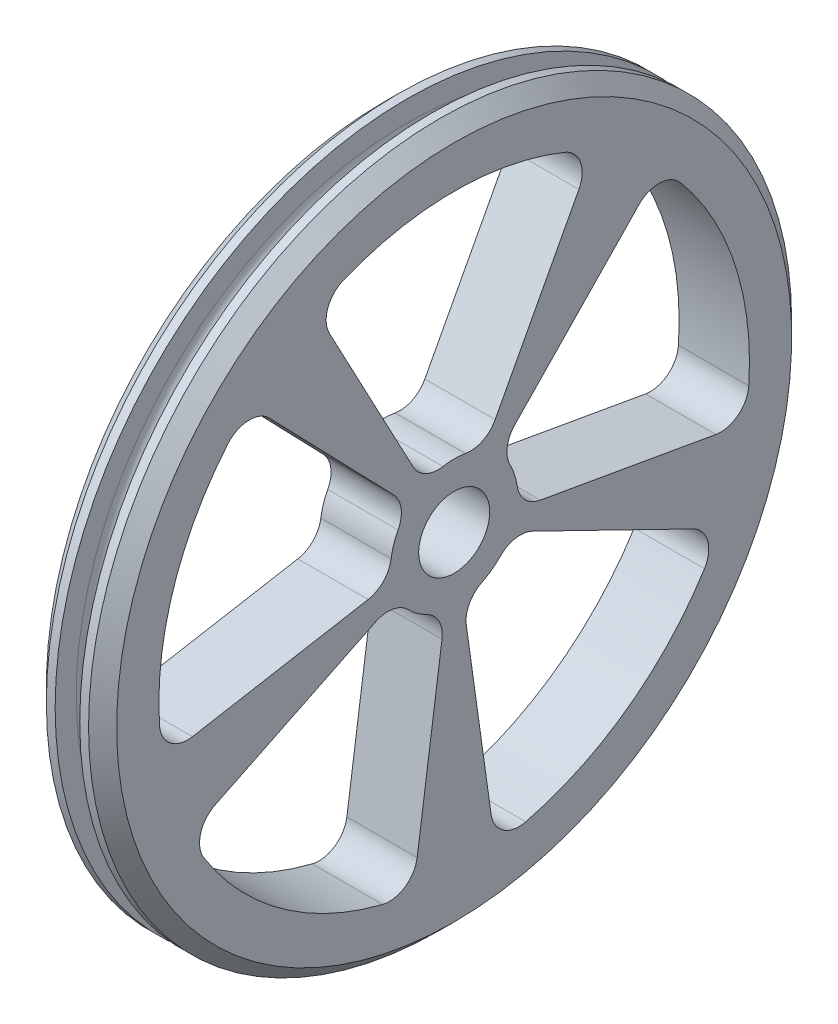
ISO-10303-21;
HEADER;
FILE_DESCRIPTION(('STEP AP214'),'2;1');
FILE_NAME('part.step','',(''),(''),'','','');
FILE_SCHEMA(('AUTOMOTIVE_DESIGN { 1 0 10303 214 1 1 1 1 }'));
ENDSEC;
DATA;
#1=APPLICATION_CONTEXT('core data for automotive mechanical design processes');
#2=APPLICATION_PROTOCOL_DEFINITION('international standard','automotive_design',2000,#1);
#3=PRODUCT_CONTEXT('',#1,'mechanical');
#4=PRODUCT('Part','Part','',(#3));
#5=PRODUCT_RELATED_PRODUCT_CATEGORY('part','',(#4));
#6=PRODUCT_DEFINITION_FORMATION('','',#4);
#7=PRODUCT_DEFINITION_CONTEXT('part definition',#1,'design');
#8=PRODUCT_DEFINITION('design','',#6,#7);
#9=PRODUCT_DEFINITION_SHAPE('','',#8);
#10=(LENGTH_UNIT() NAMED_UNIT(*) SI_UNIT(.MILLI.,.METRE.));
#11=(NAMED_UNIT(*) PLANE_ANGLE_UNIT() SI_UNIT($,.RADIAN.));
#12=(NAMED_UNIT(*) SI_UNIT($,.STERADIAN.) SOLID_ANGLE_UNIT());
#13=UNCERTAINTY_MEASURE_WITH_UNIT(LENGTH_MEASURE(1.E-05),#10,'distance_accuracy_value','');
#14=(GEOMETRIC_REPRESENTATION_CONTEXT(3) GLOBAL_UNCERTAINTY_ASSIGNED_CONTEXT((#13)) GLOBAL_UNIT_ASSIGNED_CONTEXT((#10,
#11,#12)) REPRESENTATION_CONTEXT('',''));
#15=CARTESIAN_POINT('',(0.,0.,0.));
#16=DIRECTION('',(0.,0.,1.));
#17=DIRECTION('',(1.,0.,0.));
#18=AXIS2_PLACEMENT_3D('',#15,#16,#17);
#19=CARTESIAN_POINT('',(1.75,0.,0.));
#20=DIRECTION('',(-1.,0.,0.));
#21=DIRECTION('',(0.,-1.,0.));
#22=AXIS2_PLACEMENT_3D('',#19,#20,#21);
#23=PLANE('',#22);
#24=CARTESIAN_POINT('',(1.75,0.,0.));
#25=DIRECTION('',(-1.,0.,0.));
#26=DIRECTION('',(0.,-1.,0.));
#27=AXIS2_PLACEMENT_3D('',#24,#25,#26);
#28=CIRCLE('',#27,50.);
#29=CARTESIAN_POINT('',(1.75,-50.,0.));
#30=VERTEX_POINT('',#29);
#31=EDGE_CURVE('E331',#30,#30,#28,.T.);
#32=ORIENTED_EDGE('',*,*,#31,.T.);
#33=EDGE_LOOP('',(#32));
#34=FACE_BOUND('',#33,.T.);
#35=CARTESIAN_POINT('',(1.75,0.,0.));
#36=DIRECTION('',(-1.,0.,0.));
#37=DIRECTION('',(0.,-1.,0.));
#38=AXIS2_PLACEMENT_3D('',#35,#36,#37);
#39=CIRCLE('',#38,47.);
#40=CARTESIAN_POINT('',(1.75,-47.,0.));
#41=VERTEX_POINT('',#40);
#42=EDGE_CURVE('E347',#41,#41,#39,.T.);
#43=ORIENTED_EDGE('',*,*,#42,.F.);
#44=EDGE_LOOP('',(#43));
#45=FACE_BOUND('',#44,.T.);
#46=ADVANCED_FACE('F35',(#34,#45),#23,.T.);
#47=CARTESIAN_POINT('',(0.,0.,0.));
#48=DIRECTION('',(-1.,0.,0.));
#49=DIRECTION('',(0.,-1.,0.));
#50=AXIS2_PLACEMENT_3D('',#47,#48,#49);
#51=TOROIDAL_SURFACE('',#50,47.,1.75);
#52=CARTESIAN_POINT('',(-1.75,0.,0.));
#53=DIRECTION('',(-1.,0.,0.));
#54=DIRECTION('',(0.,-1.,0.));
#55=AXIS2_PLACEMENT_3D('',#52,#53,#54);
#56=CIRCLE('',#55,47.);
#57=CARTESIAN_POINT('',(-1.75,-47.,0.));
#58=VERTEX_POINT('',#57);
#59=EDGE_CURVE('E344',#58,#58,#56,.T.);
#60=ORIENTED_EDGE('',*,*,#59,.F.);
#61=EDGE_LOOP('',(#60));
#62=FACE_BOUND('',#61,.T.);
#63=ORIENTED_EDGE('',*,*,#42,.T.);
#64=EDGE_LOOP('',(#63));
#65=FACE_BOUND('',#64,.T.);
#66=ADVANCED_FACE('F664',(#62,#65),#51,.F.);
#67=CARTESIAN_POINT('',(-1.75,0.,0.));
#68=DIRECTION('',(-1.,0.,0.));
#69=DIRECTION('',(0.,-1.,0.));
#70=AXIS2_PLACEMENT_3D('',#67,#68,#69);
#71=PLANE('',#70);
#72=CARTESIAN_POINT('',(-1.75,0.,0.));
#73=DIRECTION('',(-1.,0.,0.));
#74=DIRECTION('',(0.,-1.,0.));
#75=AXIS2_PLACEMENT_3D('',#72,#73,#74);
#76=CIRCLE('',#75,50.);
#77=CARTESIAN_POINT('',(-1.75,-50.,0.));
#78=VERTEX_POINT('',#77);
#79=EDGE_CURVE('E341',#78,#78,#76,.T.);
#80=ORIENTED_EDGE('',*,*,#79,.F.);
#81=EDGE_LOOP('',(#80));
#82=FACE_BOUND('',#81,.T.);
#83=ORIENTED_EDGE('',*,*,#59,.T.);
#84=EDGE_LOOP('',(#83));
#85=FACE_BOUND('',#84,.T.);
#86=ADVANCED_FACE('F670',(#82,#85),#71,.F.);
#87=CARTESIAN_POINT('',(0.,0.,0.));
#88=DIRECTION('',(-1.,0.,0.));
#89=DIRECTION('',(0.,-1.,0.));
#90=AXIS2_PLACEMENT_3D('',#87,#88,#89);
#91=CYLINDRICAL_SURFACE('',#90,50.);
#92=CARTESIAN_POINT('',(-2.99999999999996,0.,0.));
#93=DIRECTION('',(-1.,0.,0.));
#94=DIRECTION('',(0.,-1.,0.));
#95=AXIS2_PLACEMENT_3D('',#92,#93,#94);
#96=CIRCLE('',#95,50.);
#97=CARTESIAN_POINT('',(-2.99999999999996,-50.,0.));
#98=VERTEX_POINT('',#97);
#99=EDGE_CURVE('E359',#98,#98,#96,.F.);
#100=ORIENTED_EDGE('',*,*,#99,.T.);
#101=EDGE_LOOP('',(#100));
#102=FACE_BOUND('',#101,.T.);
#103=ORIENTED_EDGE('',*,*,#79,.T.);
#104=EDGE_LOOP('',(#103));
#105=FACE_BOUND('',#104,.T.);
#106=ADVANCED_FACE('F856',(#102,#105),#91,.T.);
#107=CARTESIAN_POINT('',(-5.,0.,0.));
#108=DIRECTION('',(-1.,0.,0.));
#109=DIRECTION('',(0.,-1.,0.));
#110=AXIS2_PLACEMENT_3D('',#107,#108,#109);
#111=PLANE('',#110);
#112=CARTESIAN_POINT('',(-5.,0.,0.));
#113=DIRECTION('',(1.,0.,0.));
#114=DIRECTION('',(0.,0.809016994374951,-0.587785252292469));
#115=AXIS2_PLACEMENT_3D('',#112,#113,#114);
#116=CIRCLE('',#115,9.05);
#117=CARTESIAN_POINT('',(-5.,-6.26950666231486,6.52654473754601));
#118=VERTEX_POINT('',#117);
#119=CARTESIAN_POINT('',(-5.,-8.14449700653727,3.94584192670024));
#120=VERTEX_POINT('',#119);
#121=EDGE_CURVE('E576',#118,#120,#116,.T.);
#122=ORIENTED_EDGE('',*,*,#121,.F.);
#123=CARTESIAN_POINT('',(-5.,-9.04055933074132,9.41120539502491));
#124=DIRECTION('',(-1.,0.,0.));
#125=DIRECTION('',(0.,-1.,0.));
#126=AXIS2_PLACEMENT_3D('',#123,#124,#125);
#127=CIRCLE('',#126,4.);
#128=CARTESIAN_POINT('',(-5.,-5.44538314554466,11.1646899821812));
#129=VERTEX_POINT('',#128);
#130=EDGE_CURVE('E451',#118,#129,#127,.F.);
#131=ORIENTED_EDGE('',*,*,#130,.T.);
#132=DIRECTION('',(0.,0.438371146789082,-0.898794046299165));
#133=VECTOR('',#132,1.);
#134=CARTESIAN_POINT('',(-5.,-3.96725887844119,8.13408611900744));
#135=LINE('',#134,#133);
#136=CARTESIAN_POINT('',(-5.,-16.5655578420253,33.9644268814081));
#137=VERTEX_POINT('',#136);
#138=EDGE_CURVE('E566',#137,#129,#135,.T.);
#139=ORIENTED_EDGE('',*,*,#138,.F.);
#140=CARTESIAN_POINT('',(-5.,-20.1607340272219,32.2109422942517));
#141=DIRECTION('',(-1.,0.,0.));
#142=DIRECTION('',(0.,-1.,0.));
#143=AXIS2_PLACEMENT_3D('',#140,#141,#142);
#144=CIRCLE('',#143,4.);
#145=CARTESIAN_POINT('',(-5.,-22.2829165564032,35.6015677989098));
#146=VERTEX_POINT('',#145);
#147=EDGE_CURVE('E455',#137,#146,#144,.F.);
#148=ORIENTED_EDGE('',*,*,#147,.T.);
#149=CARTESIAN_POINT('',(-5.,0.,0.));
#150=DIRECTION('',(-1.,0.,0.));
#151=DIRECTION('',(0.,0.809016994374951,-0.587785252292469));
#152=AXIS2_PLACEMENT_3D('',#149,#150,#151);
#153=CIRCLE('',#152,42.);
#154=CARTESIAN_POINT('',(-5.,-40.7449029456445,10.1908235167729));
#155=VERTEX_POINT('',#154);
#156=EDGE_CURVE('E583',#155,#146,#153,.T.);
#157=ORIENTED_EDGE('',*,*,#156,.F.);
#158=CARTESIAN_POINT('',(-5.,-36.8644359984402,9.2202688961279));
#159=DIRECTION('',(-1.,0.,0.));
#160=DIRECTION('',(0.,-1.,0.));
#161=AXIS2_PLACEMENT_3D('',#158,#159,#160);
#162=CIRCLE('',#161,4.);
#163=CARTESIAN_POINT('',(-5.,-37.4211284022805,5.25919662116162));
#164=VERTEX_POINT('',#163);
#165=EDGE_CURVE('E443',#155,#164,#162,.F.);
#166=ORIENTED_EDGE('',*,*,#165,.T.);
#167=DIRECTION('',(0.,-0.990268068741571,0.139173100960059));
#168=VECTOR('',#167,1.);
#169=CARTESIAN_POINT('',(-5.,-8.96192602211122,1.25951656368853));
#170=LINE('',#169,#168);
#171=CARTESIAN_POINT('',(-5.,-12.3009670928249,1.72878818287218));
#172=VERTEX_POINT('',#171);
#173=EDGE_CURVE('E579',#172,#164,#170,.T.);
#174=ORIENTED_EDGE('',*,*,#173,.F.);
#175=CARTESIAN_POINT('',(-5.,-11.7442746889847,5.68986045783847));
#176=DIRECTION('',(-1.,0.,0.));
#177=DIRECTION('',(0.,-1.,0.));
#178=AXIS2_PLACEMENT_3D('',#175,#176,#177);
#179=CIRCLE('',#178,4.);
#180=EDGE_CURVE('E447',#172,#120,#179,.F.);
#181=ORIENTED_EDGE('',*,*,#180,.T.);
#182=EDGE_LOOP('',(#122,#131,#139,#148,#157,#166,#174,#181));
#183=FACE_BOUND('',#182,.T.);
#184=CARTESIAN_POINT('',(-5.,0.,0.));
#185=DIRECTION('',(1.,0.,0.));
#186=DIRECTION('',(0.,0.809016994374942,0.58778525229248));
#187=AXIS2_PLACEMENT_3D('',#184,#185,#186);
#188=CIRCLE('',#187,9.05);
#189=CARTESIAN_POINT('',(-5.,-8.14449700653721,-3.94584192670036));
#190=VERTEX_POINT('',#189);
#191=CARTESIAN_POINT('',(-5.,-6.26950666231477,-6.5265447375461));
#192=VERTEX_POINT('',#191);
#193=EDGE_CURVE('E545',#190,#192,#188,.T.);
#194=ORIENTED_EDGE('',*,*,#193,.F.);
#195=CARTESIAN_POINT('',(-5.,-11.7442746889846,-5.68986045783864));
#196=DIRECTION('',(-1.,0.,0.));
#197=DIRECTION('',(0.,-1.,0.));
#198=AXIS2_PLACEMENT_3D('',#195,#196,#197);
#199=CIRCLE('',#198,4.);
#200=CARTESIAN_POINT('',(-5.,-12.3009670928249,-1.72878818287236));
#201=VERTEX_POINT('',#200);
#202=EDGE_CURVE('E487',#190,#201,#199,.F.);
#203=ORIENTED_EDGE('',*,*,#202,.T.);
#204=DIRECTION('',(0.,0.990268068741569,0.139173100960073));
#205=VECTOR('',#204,1.);
#206=CARTESIAN_POINT('',(-5.,-8.9619260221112,-1.25951656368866));
#207=LINE('',#206,#205);
#208=CARTESIAN_POINT('',(-5.,-37.4211284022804,-5.25919662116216));
#209=VERTEX_POINT('',#208);
#210=EDGE_CURVE('E592',#209,#201,#207,.T.);
#211=ORIENTED_EDGE('',*,*,#210,.F.);
#212=CARTESIAN_POINT('',(-5.,-36.8644359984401,-9.22026889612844));
#213=DIRECTION('',(-1.,0.,0.));
#214=DIRECTION('',(0.,-1.,0.));
#215=AXIS2_PLACEMENT_3D('',#212,#213,#214);
#216=CIRCLE('',#215,4.);
#217=CARTESIAN_POINT('',(-5.,-40.7449029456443,-10.1908235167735));
#218=VERTEX_POINT('',#217);
#219=EDGE_CURVE('E491',#209,#218,#216,.F.);
#220=ORIENTED_EDGE('',*,*,#219,.T.);
#221=CARTESIAN_POINT('',(-5.,0.,0.));
#222=DIRECTION('',(-1.,0.,0.));
#223=DIRECTION('',(0.,0.809016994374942,0.58778525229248));
#224=AXIS2_PLACEMENT_3D('',#221,#222,#223);
#225=CIRCLE('',#224,42.);
#226=CARTESIAN_POINT('',(-5.,-22.2829165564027,-35.6015677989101));
#227=VERTEX_POINT('',#226);
#228=EDGE_CURVE('E602',#227,#218,#225,.T.);
#229=ORIENTED_EDGE('',*,*,#228,.F.);
#230=CARTESIAN_POINT('',(-5.,-20.1607340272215,-32.210942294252));
#231=DIRECTION('',(-1.,0.,0.));
#232=DIRECTION('',(0.,-1.,0.));
#233=AXIS2_PLACEMENT_3D('',#230,#231,#232);
#234=CIRCLE('',#233,4.);
#235=CARTESIAN_POINT('',(-5.,-16.5655578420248,-33.9644268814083));
#236=VERTEX_POINT('',#235);
#237=EDGE_CURVE('E479',#227,#236,#234,.F.);
#238=ORIENTED_EDGE('',*,*,#237,.T.);
#239=DIRECTION('',(0.,-0.438371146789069,-0.898794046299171));
#240=VECTOR('',#239,1.);
#241=CARTESIAN_POINT('',(-5.,-3.96725887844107,-8.1340861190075));
#242=LINE('',#241,#240);
#243=CARTESIAN_POINT('',(-5.,-5.4453831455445,-11.1646899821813));
#244=VERTEX_POINT('',#243);
#245=EDGE_CURVE('E549',#244,#236,#242,.T.);
#246=ORIENTED_EDGE('',*,*,#245,.F.);
#247=CARTESIAN_POINT('',(-5.,-9.04055933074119,-9.41120539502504));
#248=DIRECTION('',(-1.,0.,0.));
#249=DIRECTION('',(0.,-1.,0.));
#250=AXIS2_PLACEMENT_3D('',#247,#248,#249);
#251=CIRCLE('',#250,4.);
#252=EDGE_CURVE('E483',#244,#192,#251,.F.);
#253=ORIENTED_EDGE('',*,*,#252,.T.);
#254=EDGE_LOOP('',(#194,#203,#211,#220,#229,#238,#246,#253));
#255=FACE_BOUND('',#254,.T.);
#256=CARTESIAN_POINT('',(-5.,0.,0.));
#257=DIRECTION('',(1.,0.,0.));
#258=DIRECTION('',(0.,-0.309016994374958,0.95105651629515));
#259=AXIS2_PLACEMENT_3D('',#256,#257,#258);
#260=CIRCLE('',#259,9.05);
#261=CARTESIAN_POINT('',(-5.,1.23593069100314,-8.96520916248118));
#262=VERTEX_POINT('',#261);
#263=CARTESIAN_POINT('',(-5.,4.26972879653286,-7.97946840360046));
#264=VERTEX_POINT('',#263);
#265=EDGE_CURVE('E555',#262,#264,#260,.T.);
#266=ORIENTED_EDGE('',*,*,#265,.F.);
#267=CARTESIAN_POINT('',(-5.,1.7821983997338,-12.9277325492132));
#268=DIRECTION('',(-1.,0.,0.));
#269=DIRECTION('',(0.,-1.,0.));
#270=AXIS2_PLACEMENT_3D('',#267,#268,#269);
#271=CIRCLE('',#270,4.);
#272=CARTESIAN_POINT('',(-5.,-2.15703261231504,-12.2331398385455));
#273=VERTEX_POINT('',#272);
#274=EDGE_CURVE('E522',#262,#273,#271,.F.);
#275=ORIENTED_EDGE('',*,*,#274,.T.);
#276=DIRECTION('',(0.,0.17364817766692,0.98480775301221));
#277=VECTOR('',#276,1.);
#278=CARTESIAN_POINT('',(-5.,-1.57151600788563,-8.9125101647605));
#279=LINE('',#278,#277);
#280=CARTESIAN_POINT('',(-5.,-6.56197140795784,-37.2147891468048));
#281=VERTEX_POINT('',#280);
#282=EDGE_CURVE('E532',#281,#273,#279,.T.);
#283=ORIENTED_EDGE('',*,*,#282,.F.);
#284=CARTESIAN_POINT('',(-5.,-2.622740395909,-37.9093818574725));
#285=DIRECTION('',(-1.,0.,0.));
#286=DIRECTION('',(0.,-1.,0.));
#287=AXIS2_PLACEMENT_3D('',#284,#285,#286);
#288=CIRCLE('',#287,4.);
#289=CARTESIAN_POINT('',(-5.,-2.89881833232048,-41.8998431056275));
#290=VERTEX_POINT('',#289);
#291=EDGE_CURVE('E43',#281,#290,#288,.F.);
#292=ORIENTED_EDGE('',*,*,#291,.T.);
#293=CARTESIAN_POINT('',(-5.,0.,0.));
#294=DIRECTION('',(-1.,0.,0.));
#295=DIRECTION('',(0.,-0.309016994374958,0.95105651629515));
#296=AXIS2_PLACEMENT_3D('',#293,#294,#295);
#297=CIRCLE('',#296,42.);
#298=CARTESIAN_POINT('',(-5.,26.97330314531,-32.193802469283));
#299=VERTEX_POINT('',#298);
#300=EDGE_CURVE('E531',#299,#290,#297,.T.);
#301=ORIENTED_EDGE('',*,*,#300,.F.);
#302=CARTESIAN_POINT('',(-5.,24.4044171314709,-29.127726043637));
#303=DIRECTION('',(-1.,0.,0.));
#304=DIRECTION('',(0.,-1.,0.));
#305=AXIS2_PLACEMENT_3D('',#302,#303,#304);
#306=CIRCLE('',#305,4.);
#307=CARTESIAN_POINT('',(-5.,27.1830506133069,-26.2503668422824));
#308=VERTEX_POINT('',#307);
#309=EDGE_CURVE('E514',#299,#308,#306,.F.);
#310=ORIENTED_EDGE('',*,*,#309,.T.);
#311=DIRECTION('',(0.,0.71933980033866,-0.694658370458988));
#312=VECTOR('',#311,1.);
#313=CARTESIAN_POINT('',(-5.,6.51002519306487,-6.28665825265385));
#314=LINE('',#313,#312);
#315=CARTESIAN_POINT('',(-5.,8.93553522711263,-8.62894606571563));
#316=VERTEX_POINT('',#315);
#317=EDGE_CURVE('E540',#316,#308,#314,.T.);
#318=ORIENTED_EDGE('',*,*,#317,.F.);
#319=CARTESIAN_POINT('',(-5.,6.15690174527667,-11.5063052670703));
#320=DIRECTION('',(-1.,0.,0.));
#321=DIRECTION('',(0.,-1.,0.));
#322=AXIS2_PLACEMENT_3D('',#319,#320,#321);
#323=CIRCLE('',#322,4.);
#324=EDGE_CURVE('E518',#316,#264,#323,.F.);
#325=ORIENTED_EDGE('',*,*,#324,.T.);
#326=EDGE_LOOP('',(#266,#275,#283,#292,#301,#310,#318,#325));
#327=FACE_BOUND('',#326,.T.);
#328=CARTESIAN_POINT('',(-5.,0.,0.));
#329=DIRECTION('',(1.,0.,0.));
#330=DIRECTION('',(0.,-0.309016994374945,-0.951056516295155));
#331=AXIS2_PLACEMENT_3D('',#328,#329,#330);
#332=CIRCLE('',#331,9.05);
#333=CARTESIAN_POINT('',(-5.,4.26972879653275,7.97946840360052));
#334=VERTEX_POINT('',#333);
#335=CARTESIAN_POINT('',(-5.,1.23593069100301,8.9652091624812));
#336=VERTEX_POINT('',#335);
#337=EDGE_CURVE('E575',#334,#336,#332,.T.);
#338=ORIENTED_EDGE('',*,*,#337,.F.);
#339=CARTESIAN_POINT('',(-5.,6.15690174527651,11.5063052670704));
#340=DIRECTION('',(-1.,0.,0.));
#341=DIRECTION('',(0.,-1.,0.));
#342=AXIS2_PLACEMENT_3D('',#339,#340,#341);
#343=CIRCLE('',#342,4.);
#344=CARTESIAN_POINT('',(-5.,8.93553522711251,8.62894606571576));
#345=VERTEX_POINT('',#344);
#346=EDGE_CURVE('E415',#334,#345,#343,.F.);
#347=ORIENTED_EDGE('',*,*,#346,.T.);
#348=DIRECTION('',(0.,-0.71933980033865,-0.694658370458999));
#349=VECTOR('',#348,1.);
#350=CARTESIAN_POINT('',(-5.,6.51002519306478,6.28665825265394));
#351=LINE('',#350,#349);
#352=CARTESIAN_POINT('',(-5.,27.1830506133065,26.2503668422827));
#353=VERTEX_POINT('',#352);
#354=EDGE_CURVE('E611',#353,#345,#351,.T.);
#355=ORIENTED_EDGE('',*,*,#354,.F.);
#356=CARTESIAN_POINT('',(-5.,24.4044171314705,29.1277260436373));
#357=DIRECTION('',(-1.,0.,0.));
#358=DIRECTION('',(0.,-1.,0.));
#359=AXIS2_PLACEMENT_3D('',#356,#357,#358);
#360=CIRCLE('',#359,4.);
#361=CARTESIAN_POINT('',(-5.,26.9733031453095,32.1938024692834));
#362=VERTEX_POINT('',#361);
#363=EDGE_CURVE('E419',#353,#362,#360,.F.);
#364=ORIENTED_EDGE('',*,*,#363,.T.);
#365=CARTESIAN_POINT('',(-5.,0.,0.));
#366=DIRECTION('',(-1.,0.,0.));
#367=DIRECTION('',(0.,-0.309016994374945,-0.951056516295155));
#368=AXIS2_PLACEMENT_3D('',#365,#366,#367);
#369=CIRCLE('',#368,42.);
#370=CARTESIAN_POINT('',(-5.,-2.89881833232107,41.8998431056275));
#371=VERTEX_POINT('',#370);
#372=EDGE_CURVE('E625',#371,#362,#369,.T.);
#373=ORIENTED_EDGE('',*,*,#372,.F.);
#374=CARTESIAN_POINT('',(-5.,-2.62274039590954,37.9093818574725));
#375=DIRECTION('',(-1.,0.,0.));
#376=DIRECTION('',(0.,-1.,0.));
#377=AXIS2_PLACEMENT_3D('',#374,#375,#376);
#378=CIRCLE('',#377,4.);
#379=CARTESIAN_POINT('',(-5.,-6.56197140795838,37.2147891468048));
#380=VERTEX_POINT('',#379);
#381=EDGE_CURVE('E407',#371,#380,#378,.F.);
#382=ORIENTED_EDGE('',*,*,#381,.T.);
#383=DIRECTION('',(0.,-0.173648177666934,0.984807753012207));
#384=VECTOR('',#383,1.);
#385=CARTESIAN_POINT('',(-5.,-1.57151600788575,8.91251016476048));
#386=LINE('',#385,#384);
#387=CARTESIAN_POINT('',(-5.,-2.15703261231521,12.2331398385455));
#388=VERTEX_POINT('',#387);
#389=EDGE_CURVE('E622',#388,#380,#386,.T.);
#390=ORIENTED_EDGE('',*,*,#389,.F.);
#391=CARTESIAN_POINT('',(-5.,1.78219839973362,12.9277325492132));
#392=DIRECTION('',(-1.,0.,0.));
#393=DIRECTION('',(0.,-1.,0.));
#394=AXIS2_PLACEMENT_3D('',#391,#392,#393);
#395=CIRCLE('',#394,4.);
#396=EDGE_CURVE('E411',#388,#336,#395,.F.);
#397=ORIENTED_EDGE('',*,*,#396,.T.);
#398=EDGE_LOOP('',(#338,#347,#355,#364,#373,#382,#390,#397));
#399=FACE_BOUND('',#398,.T.);
#400=CARTESIAN_POINT('',(-5.,0.,0.));
#401=DIRECTION('',(1.,0.,0.));
#402=DIRECTION('',(0.,-1.,0.));
#403=AXIS2_PLACEMENT_3D('',#400,#401,#402);
#404=CIRCLE('',#403,9.05);
#405=CARTESIAN_POINT('',(-5.,8.90834418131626,-1.59496205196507));
#406=VERTEX_POINT('',#405);
#407=CARTESIAN_POINT('',(-5.,8.90834418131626,1.59496205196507));
#408=VERTEX_POINT('',#407);
#409=EDGE_CURVE('E327',#406,#408,#404,.T.);
#410=ORIENTED_EDGE('',*,*,#409,.F.);
#411=CARTESIAN_POINT('',(-5.,12.8457338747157,-2.29991765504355));
#412=DIRECTION('',(-1.,0.,0.));
#413=DIRECTION('',(0.,-1.,0.));
#414=AXIS2_PLACEMENT_3D('',#411,#412,#413);
#415=CIRCLE('',#414,4.);
#416=CARTESIAN_POINT('',(-5.,10.9678476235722,-5.83170802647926));
#417=VERTEX_POINT('',#416);
#418=EDGE_CURVE('E380',#406,#417,#415,.F.);
#419=ORIENTED_EDGE('',*,*,#418,.T.);
#420=DIRECTION('',(0.,-0.882947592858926,0.469471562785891));
#421=VECTOR('',#420,1.);
#422=CARTESIAN_POINT('',(-5.,7.99067571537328,-4.24871764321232));
#423=LINE('',#422,#421);
#424=CARTESIAN_POINT('',(-5.,33.3656070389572,-17.7408079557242));
#425=VERTEX_POINT('',#424);
#426=EDGE_CURVE('E321',#425,#417,#423,.T.);
#427=ORIENTED_EDGE('',*,*,#426,.F.);
#428=CARTESIAN_POINT('',(-5.,35.2434932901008,-14.2090175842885));
#429=DIRECTION('',(-1.,0.,0.));
#430=DIRECTION('',(0.,-1.,0.));
#431=AXIS2_PLACEMENT_3D('',#428,#429,#430);
#432=CIRCLE('',#431,4.);
#433=CARTESIAN_POINT('',(-5.,38.9533346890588,-15.7047036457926));
#434=VERTEX_POINT('',#433);
#435=EDGE_CURVE('E320',#425,#434,#432,.F.);
#436=ORIENTED_EDGE('',*,*,#435,.T.);
#437=CARTESIAN_POINT('',(-5.,0.,0.));
#438=DIRECTION('',(-1.,0.,0.));
#439=DIRECTION('',(0.,-1.,0.));
#440=AXIS2_PLACEMENT_3D('',#437,#438,#439);
#441=CIRCLE('',#440,42.);
#442=CARTESIAN_POINT('',(-5.,38.9533346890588,15.7047036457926));
#443=VERTEX_POINT('',#442);
#444=EDGE_CURVE('E309',#443,#434,#441,.T.);
#445=ORIENTED_EDGE('',*,*,#444,.F.);
#446=CARTESIAN_POINT('',(-5.,35.2434932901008,14.2090175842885));
#447=DIRECTION('',(-1.,0.,0.));
#448=DIRECTION('',(0.,-1.,0.));
#449=AXIS2_PLACEMENT_3D('',#446,#447,#448);
#450=CIRCLE('',#449,4.);
#451=CARTESIAN_POINT('',(-5.,33.3656070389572,17.7408079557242));
#452=VERTEX_POINT('',#451);
#453=EDGE_CURVE('E292',#443,#452,#450,.F.);
#454=ORIENTED_EDGE('',*,*,#453,.T.);
#455=DIRECTION('',(0.,0.882947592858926,0.469471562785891));
#456=VECTOR('',#455,1.);
#457=CARTESIAN_POINT('',(-5.,7.99067571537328,4.24871764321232));
#458=LINE('',#457,#456);
#459=CARTESIAN_POINT('',(-5.,10.9678476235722,5.83170802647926));
#460=VERTEX_POINT('',#459);
#461=EDGE_CURVE('E322',#460,#452,#458,.T.);
#462=ORIENTED_EDGE('',*,*,#461,.F.);
#463=CARTESIAN_POINT('',(-5.,12.8457338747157,2.29991765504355));
#464=DIRECTION('',(-1.,0.,0.));
#465=DIRECTION('',(0.,-1.,0.));
#466=AXIS2_PLACEMENT_3D('',#463,#464,#465);
#467=CIRCLE('',#466,4.);
#468=EDGE_CURVE('E376',#460,#408,#467,.F.);
#469=ORIENTED_EDGE('',*,*,#468,.T.);
#470=EDGE_LOOP('',(#410,#419,#427,#436,#445,#454,#462,#469));
#471=FACE_BOUND('',#470,.T.);
#472=CARTESIAN_POINT('',(-5.,0.,0.));
#473=DIRECTION('',(-1.,0.,0.));
#474=DIRECTION('',(0.,-1.,0.));
#475=AXIS2_PLACEMENT_3D('',#472,#473,#474);
#476=CIRCLE('',#475,48.);
#477=CARTESIAN_POINT('',(-5.,-48.,0.));
#478=VERTEX_POINT('',#477);
#479=EDGE_CURVE('E356',#478,#478,#476,.T.);
#480=ORIENTED_EDGE('',*,*,#479,.T.);
#481=EDGE_LOOP('',(#480));
#482=FACE_BOUND('',#481,.T.);
#483=CARTESIAN_POINT('',(-5.,0.,0.));
#484=DIRECTION('',(-1.,0.,0.));
#485=DIRECTION('',(0.,-1.,0.));
#486=AXIS2_PLACEMENT_3D('',#483,#484,#485);
#487=CIRCLE('',#486,5.05);
#488=CARTESIAN_POINT('',(-5.,-5.05,0.));
#489=VERTEX_POINT('',#488);
#490=EDGE_CURVE('E338',#489,#489,#487,.T.);
#491=ORIENTED_EDGE('',*,*,#490,.F.);
#492=EDGE_LOOP('',(#491));
#493=FACE_BOUND('',#492,.T.);
#494=ADVANCED_FACE('F317',(#183,#255,#327,#399,#471,#482,#493),#111,.T.);
#495=CARTESIAN_POINT('',(0.,0.,0.));
#496=DIRECTION('',(-1.,0.,0.));
#497=DIRECTION('',(0.,-1.,0.));
#498=AXIS2_PLACEMENT_3D('',#495,#496,#497);
#499=CYLINDRICAL_SURFACE('',#498,5.05);
#500=CARTESIAN_POINT('',(5.,0.,0.));
#501=DIRECTION('',(-1.,0.,0.));
#502=DIRECTION('',(0.,-1.,0.));
#503=AXIS2_PLACEMENT_3D('',#500,#501,#502);
#504=CIRCLE('',#503,5.05);
#505=CARTESIAN_POINT('',(5.,-5.05,0.));
#506=VERTEX_POINT('',#505);
#507=EDGE_CURVE('E334',#506,#506,#504,.T.);
#508=ORIENTED_EDGE('',*,*,#507,.F.);
#509=EDGE_LOOP('',(#508));
#510=FACE_BOUND('',#509,.T.);
#511=ORIENTED_EDGE('',*,*,#490,.T.);
#512=EDGE_LOOP('',(#511));
#513=FACE_BOUND('',#512,.T.);
#514=ADVANCED_FACE('F849',(#510,#513),#499,.F.);
#515=CARTESIAN_POINT('',(5.,0.,0.));
#516=DIRECTION('',(-1.,0.,0.));
#517=DIRECTION('',(0.,-1.,0.));
#518=AXIS2_PLACEMENT_3D('',#515,#516,#517);
#519=PLANE('',#518);
#520=CARTESIAN_POINT('',(5.,0.,0.));
#521=DIRECTION('',(-1.,0.,0.));
#522=DIRECTION('',(0.,0.809016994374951,-0.587785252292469));
#523=AXIS2_PLACEMENT_3D('',#520,#521,#522);
#524=CIRCLE('',#523,42.);
#525=CARTESIAN_POINT('',(5.,-40.7449029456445,10.1908235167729));
#526=VERTEX_POINT('',#525);
#527=CARTESIAN_POINT('',(5.,-22.2829165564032,35.6015677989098));
#528=VERTEX_POINT('',#527);
#529=EDGE_CURVE('E569',#526,#528,#524,.T.);
#530=ORIENTED_EDGE('',*,*,#529,.T.);
#531=CARTESIAN_POINT('',(5.,-20.1607340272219,32.2109422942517));
#532=DIRECTION('',(-1.,0.,0.));
#533=DIRECTION('',(0.,-1.,0.));
#534=AXIS2_PLACEMENT_3D('',#531,#532,#533);
#535=CIRCLE('',#534,4.);
#536=CARTESIAN_POINT('',(5.,-16.5655578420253,33.9644268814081));
#537=VERTEX_POINT('',#536);
#538=EDGE_CURVE('E457',#528,#537,#535,.T.);
#539=ORIENTED_EDGE('',*,*,#538,.T.);
#540=DIRECTION('',(0.,0.438371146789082,-0.898794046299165));
#541=VECTOR('',#540,1.);
#542=CARTESIAN_POINT('',(5.,-3.96725887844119,8.13408611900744));
#543=LINE('',#542,#541);
#544=CARTESIAN_POINT('',(5.,-5.44538314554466,11.1646899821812));
#545=VERTEX_POINT('',#544);
#546=EDGE_CURVE('E572',#537,#545,#543,.T.);
#547=ORIENTED_EDGE('',*,*,#546,.T.);
#548=CARTESIAN_POINT('',(5.,-9.04055933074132,9.41120539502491));
#549=DIRECTION('',(-1.,0.,0.));
#550=DIRECTION('',(0.,-1.,0.));
#551=AXIS2_PLACEMENT_3D('',#548,#549,#550);
#552=CIRCLE('',#551,4.);
#553=CARTESIAN_POINT('',(5.,-6.26950666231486,6.52654473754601));
#554=VERTEX_POINT('',#553);
#555=EDGE_CURVE('E453',#545,#554,#552,.T.);
#556=ORIENTED_EDGE('',*,*,#555,.T.);
#557=CARTESIAN_POINT('',(5.,0.,0.));
#558=DIRECTION('',(1.,0.,0.));
#559=DIRECTION('',(0.,0.809016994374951,-0.587785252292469));
#560=AXIS2_PLACEMENT_3D('',#557,#558,#559);
#561=CIRCLE('',#560,9.05);
#562=CARTESIAN_POINT('',(5.,-8.14449700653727,3.94584192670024));
#563=VERTEX_POINT('',#562);
#564=EDGE_CURVE('E562',#554,#563,#561,.T.);
#565=ORIENTED_EDGE('',*,*,#564,.T.);
#566=CARTESIAN_POINT('',(5.,-11.7442746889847,5.68986045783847));
#567=DIRECTION('',(-1.,0.,0.));
#568=DIRECTION('',(0.,-1.,0.));
#569=AXIS2_PLACEMENT_3D('',#566,#567,#568);
#570=CIRCLE('',#569,4.);
#571=CARTESIAN_POINT('',(5.,-12.3009670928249,1.72878818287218));
#572=VERTEX_POINT('',#571);
#573=EDGE_CURVE('E449',#563,#572,#570,.T.);
#574=ORIENTED_EDGE('',*,*,#573,.T.);
#575=DIRECTION('',(0.,-0.990268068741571,0.139173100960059));
#576=VECTOR('',#575,1.);
#577=CARTESIAN_POINT('',(5.,-8.96192602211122,1.25951656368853));
#578=LINE('',#577,#576);
#579=CARTESIAN_POINT('',(5.,-37.4211284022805,5.25919662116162));
#580=VERTEX_POINT('',#579);
#581=EDGE_CURVE('E565',#572,#580,#578,.T.);
#582=ORIENTED_EDGE('',*,*,#581,.T.);
#583=CARTESIAN_POINT('',(5.,-36.8644359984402,9.2202688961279));
#584=DIRECTION('',(-1.,0.,0.));
#585=DIRECTION('',(0.,-1.,0.));
#586=AXIS2_PLACEMENT_3D('',#583,#584,#585);
#587=CIRCLE('',#586,4.);
#588=EDGE_CURVE('E445',#580,#526,#587,.T.);
#589=ORIENTED_EDGE('',*,*,#588,.T.);
#590=EDGE_LOOP('',(#530,#539,#547,#556,#565,#574,#582,#589));
#591=FACE_BOUND('',#590,.T.);
#592=CARTESIAN_POINT('',(5.,0.,0.));
#593=DIRECTION('',(-1.,0.,0.));
#594=DIRECTION('',(0.,0.809016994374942,0.58778525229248));
#595=AXIS2_PLACEMENT_3D('',#592,#593,#594);
#596=CIRCLE('',#595,42.);
#597=CARTESIAN_POINT('',(5.,-22.2829165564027,-35.6015677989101));
#598=VERTEX_POINT('',#597);
#599=CARTESIAN_POINT('',(5.,-40.7449029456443,-10.1908235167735));
#600=VERTEX_POINT('',#599);
#601=EDGE_CURVE('E595',#598,#600,#596,.T.);
#602=ORIENTED_EDGE('',*,*,#601,.T.);
#603=CARTESIAN_POINT('',(5.,-36.8644359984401,-9.22026889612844));
#604=DIRECTION('',(-1.,0.,0.));
#605=DIRECTION('',(0.,-1.,0.));
#606=AXIS2_PLACEMENT_3D('',#603,#604,#605);
#607=CIRCLE('',#606,4.);
#608=CARTESIAN_POINT('',(5.,-37.4211284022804,-5.25919662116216));
#609=VERTEX_POINT('',#608);
#610=EDGE_CURVE('E493',#600,#609,#607,.T.);
#611=ORIENTED_EDGE('',*,*,#610,.T.);
#612=DIRECTION('',(0.,0.990268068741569,0.139173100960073));
#613=VECTOR('',#612,1.);
#614=CARTESIAN_POINT('',(5.,-8.9619260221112,-1.25951656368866));
#615=LINE('',#614,#613);
#616=CARTESIAN_POINT('',(5.,-12.3009670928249,-1.72878818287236));
#617=VERTEX_POINT('',#616);
#618=EDGE_CURVE('E580',#609,#617,#615,.T.);
#619=ORIENTED_EDGE('',*,*,#618,.T.);
#620=CARTESIAN_POINT('',(5.,-11.7442746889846,-5.68986045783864));
#621=DIRECTION('',(-1.,0.,0.));
#622=DIRECTION('',(0.,-1.,0.));
#623=AXIS2_PLACEMENT_3D('',#620,#621,#622);
#624=CIRCLE('',#623,4.);
#625=CARTESIAN_POINT('',(5.,-8.14449700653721,-3.94584192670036));
#626=VERTEX_POINT('',#625);
#627=EDGE_CURVE('E489',#617,#626,#624,.T.);
#628=ORIENTED_EDGE('',*,*,#627,.T.);
#629=CARTESIAN_POINT('',(5.,0.,0.));
#630=DIRECTION('',(1.,0.,0.));
#631=DIRECTION('',(0.,0.809016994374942,0.58778525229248));
#632=AXIS2_PLACEMENT_3D('',#629,#630,#631);
#633=CIRCLE('',#632,9.05);
#634=CARTESIAN_POINT('',(5.,-6.26950666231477,-6.5265447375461));
#635=VERTEX_POINT('',#634);
#636=EDGE_CURVE('E588',#626,#635,#633,.T.);
#637=ORIENTED_EDGE('',*,*,#636,.T.);
#638=CARTESIAN_POINT('',(5.,-9.04055933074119,-9.41120539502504));
#639=DIRECTION('',(-1.,0.,0.));
#640=DIRECTION('',(0.,-1.,0.));
#641=AXIS2_PLACEMENT_3D('',#638,#639,#640);
#642=CIRCLE('',#641,4.);
#643=CARTESIAN_POINT('',(5.,-5.4453831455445,-11.1646899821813));
#644=VERTEX_POINT('',#643);
#645=EDGE_CURVE('E485',#635,#644,#642,.T.);
#646=ORIENTED_EDGE('',*,*,#645,.T.);
#647=DIRECTION('',(0.,-0.438371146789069,-0.898794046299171));
#648=VECTOR('',#647,1.);
#649=CARTESIAN_POINT('',(5.,-3.96725887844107,-8.1340861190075));
#650=LINE('',#649,#648);
#651=CARTESIAN_POINT('',(5.,-16.5655578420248,-33.9644268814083));
#652=VERTEX_POINT('',#651);
#653=EDGE_CURVE('E591',#644,#652,#650,.T.);
#654=ORIENTED_EDGE('',*,*,#653,.T.);
#655=CARTESIAN_POINT('',(5.,-20.1607340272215,-32.210942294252));
#656=DIRECTION('',(-1.,0.,0.));
#657=DIRECTION('',(0.,-1.,0.));
#658=AXIS2_PLACEMENT_3D('',#655,#656,#657);
#659=CIRCLE('',#658,4.);
#660=EDGE_CURVE('E481',#652,#598,#659,.T.);
#661=ORIENTED_EDGE('',*,*,#660,.T.);
#662=EDGE_LOOP('',(#602,#611,#619,#628,#637,#646,#654,#661));
#663=FACE_BOUND('',#662,.T.);
#664=CARTESIAN_POINT('',(5.,0.,0.));
#665=DIRECTION('',(-1.,0.,0.));
#666=DIRECTION('',(0.,-0.309016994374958,0.95105651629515));
#667=AXIS2_PLACEMENT_3D('',#664,#665,#666);
#668=CIRCLE('',#667,42.);
#669=CARTESIAN_POINT('',(5.,26.97330314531,-32.193802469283));
#670=VERTEX_POINT('',#669);
#671=CARTESIAN_POINT('',(5.,-2.89881833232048,-41.8998431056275));
#672=VERTEX_POINT('',#671);
#673=EDGE_CURVE('E546',#670,#672,#668,.T.);
#674=ORIENTED_EDGE('',*,*,#673,.T.);
#675=CARTESIAN_POINT('',(5.,-2.622740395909,-37.9093818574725));
#676=DIRECTION('',(-1.,0.,0.));
#677=DIRECTION('',(0.,-1.,0.));
#678=AXIS2_PLACEMENT_3D('',#675,#676,#677);
#679=CIRCLE('',#678,4.);
#680=CARTESIAN_POINT('',(5.,-6.56197140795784,-37.2147891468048));
#681=VERTEX_POINT('',#680);
#682=EDGE_CURVE('E11',#672,#681,#679,.T.);
#683=ORIENTED_EDGE('',*,*,#682,.T.);
#684=DIRECTION('',(0.,0.17364817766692,0.98480775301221));
#685=VECTOR('',#684,1.);
#686=CARTESIAN_POINT('',(5.,-1.57151600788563,-8.9125101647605));
#687=LINE('',#686,#685);
#688=CARTESIAN_POINT('',(5.,-2.15703261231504,-12.2331398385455));
#689=VERTEX_POINT('',#688);
#690=EDGE_CURVE('E543',#681,#689,#687,.T.);
#691=ORIENTED_EDGE('',*,*,#690,.T.);
#692=CARTESIAN_POINT('',(5.,1.7821983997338,-12.9277325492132));
#693=DIRECTION('',(-1.,0.,0.));
#694=DIRECTION('',(0.,-1.,0.));
#695=AXIS2_PLACEMENT_3D('',#692,#693,#694);
#696=CIRCLE('',#695,4.);
#697=CARTESIAN_POINT('',(5.,1.23593069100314,-8.96520916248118));
#698=VERTEX_POINT('',#697);
#699=EDGE_CURVE('E524',#689,#698,#696,.T.);
#700=ORIENTED_EDGE('',*,*,#699,.T.);
#701=CARTESIAN_POINT('',(5.,0.,0.));
#702=DIRECTION('',(1.,0.,0.));
#703=DIRECTION('',(0.,-0.309016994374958,0.95105651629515));
#704=AXIS2_PLACEMENT_3D('',#701,#702,#703);
#705=CIRCLE('',#704,9.05);
#706=CARTESIAN_POINT('',(5.,4.26972879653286,-7.97946840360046));
#707=VERTEX_POINT('',#706);
#708=EDGE_CURVE('E561',#698,#707,#705,.T.);
#709=ORIENTED_EDGE('',*,*,#708,.T.);
#710=CARTESIAN_POINT('',(5.,6.15690174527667,-11.5063052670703));
#711=DIRECTION('',(-1.,0.,0.));
#712=DIRECTION('',(0.,-1.,0.));
#713=AXIS2_PLACEMENT_3D('',#710,#711,#712);
#714=CIRCLE('',#713,4.);
#715=CARTESIAN_POINT('',(5.,8.93553522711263,-8.62894606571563));
#716=VERTEX_POINT('',#715);
#717=EDGE_CURVE('E520',#707,#716,#714,.T.);
#718=ORIENTED_EDGE('',*,*,#717,.T.);
#719=DIRECTION('',(0.,0.71933980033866,-0.694658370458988));
#720=VECTOR('',#719,1.);
#721=CARTESIAN_POINT('',(5.,6.51002519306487,-6.28665825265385));
#722=LINE('',#721,#720);
#723=CARTESIAN_POINT('',(5.,27.1830506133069,-26.2503668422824));
#724=VERTEX_POINT('',#723);
#725=EDGE_CURVE('E551',#716,#724,#722,.T.);
#726=ORIENTED_EDGE('',*,*,#725,.T.);
#727=CARTESIAN_POINT('',(5.,24.4044171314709,-29.127726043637));
#728=DIRECTION('',(-1.,0.,0.));
#729=DIRECTION('',(0.,-1.,0.));
#730=AXIS2_PLACEMENT_3D('',#727,#728,#729);
#731=CIRCLE('',#730,4.);
#732=EDGE_CURVE('E516',#724,#670,#731,.T.);
#733=ORIENTED_EDGE('',*,*,#732,.T.);
#734=EDGE_LOOP('',(#674,#683,#691,#700,#709,#718,#726,#733));
#735=FACE_BOUND('',#734,.T.);
#736=CARTESIAN_POINT('',(5.,0.,0.));
#737=DIRECTION('',(-1.,0.,0.));
#738=DIRECTION('',(0.,-0.309016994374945,-0.951056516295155));
#739=AXIS2_PLACEMENT_3D('',#736,#737,#738);
#740=CIRCLE('',#739,42.);
#741=CARTESIAN_POINT('',(5.,-2.89881833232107,41.8998431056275));
#742=VERTEX_POINT('',#741);
#743=CARTESIAN_POINT('',(5.,26.9733031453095,32.1938024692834));
#744=VERTEX_POINT('',#743);
#745=EDGE_CURVE('E614',#742,#744,#740,.T.);
#746=ORIENTED_EDGE('',*,*,#745,.T.);
#747=CARTESIAN_POINT('',(5.,24.4044171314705,29.1277260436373));
#748=DIRECTION('',(-1.,0.,0.));
#749=DIRECTION('',(0.,-1.,0.));
#750=AXIS2_PLACEMENT_3D('',#747,#748,#749);
#751=CIRCLE('',#750,4.);
#752=CARTESIAN_POINT('',(5.,27.1830506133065,26.2503668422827));
#753=VERTEX_POINT('',#752);
#754=EDGE_CURVE('E421',#744,#753,#751,.T.);
#755=ORIENTED_EDGE('',*,*,#754,.T.);
#756=DIRECTION('',(0.,-0.71933980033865,-0.694658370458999));
#757=VECTOR('',#756,1.);
#758=CARTESIAN_POINT('',(5.,6.51002519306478,6.28665825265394));
#759=LINE('',#758,#757);
#760=CARTESIAN_POINT('',(5.,8.93553522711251,8.62894606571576));
#761=VERTEX_POINT('',#760);
#762=EDGE_CURVE('E617',#753,#761,#759,.T.);
#763=ORIENTED_EDGE('',*,*,#762,.T.);
#764=CARTESIAN_POINT('',(5.,6.15690174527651,11.5063052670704));
#765=DIRECTION('',(-1.,0.,0.));
#766=DIRECTION('',(0.,-1.,0.));
#767=AXIS2_PLACEMENT_3D('',#764,#765,#766);
#768=CIRCLE('',#767,4.);
#769=CARTESIAN_POINT('',(5.,4.26972879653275,7.97946840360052));
#770=VERTEX_POINT('',#769);
#771=EDGE_CURVE('E417',#761,#770,#768,.T.);
#772=ORIENTED_EDGE('',*,*,#771,.T.);
#773=CARTESIAN_POINT('',(5.,0.,0.));
#774=DIRECTION('',(1.,0.,0.));
#775=DIRECTION('',(0.,-0.309016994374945,-0.951056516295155));
#776=AXIS2_PLACEMENT_3D('',#773,#774,#775);
#777=CIRCLE('',#776,9.05);
#778=CARTESIAN_POINT('',(5.,1.23593069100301,8.9652091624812));
#779=VERTEX_POINT('',#778);
#780=EDGE_CURVE('E607',#770,#779,#777,.T.);
#781=ORIENTED_EDGE('',*,*,#780,.T.);
#782=CARTESIAN_POINT('',(5.,1.78219839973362,12.9277325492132));
#783=DIRECTION('',(-1.,0.,0.));
#784=DIRECTION('',(0.,-1.,0.));
#785=AXIS2_PLACEMENT_3D('',#782,#783,#784);
#786=CIRCLE('',#785,4.);
#787=CARTESIAN_POINT('',(5.,-2.15703261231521,12.2331398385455));
#788=VERTEX_POINT('',#787);
#789=EDGE_CURVE('E413',#779,#788,#786,.T.);
#790=ORIENTED_EDGE('',*,*,#789,.T.);
#791=DIRECTION('',(0.,-0.173648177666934,0.984807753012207));
#792=VECTOR('',#791,1.);
#793=CARTESIAN_POINT('',(5.,-1.57151600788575,8.91251016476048));
#794=LINE('',#793,#792);
#795=CARTESIAN_POINT('',(5.,-6.56197140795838,37.2147891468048));
#796=VERTEX_POINT('',#795);
#797=EDGE_CURVE('E610',#788,#796,#794,.T.);
#798=ORIENTED_EDGE('',*,*,#797,.T.);
#799=CARTESIAN_POINT('',(5.,-2.62274039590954,37.9093818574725));
#800=DIRECTION('',(-1.,0.,0.));
#801=DIRECTION('',(0.,-1.,0.));
#802=AXIS2_PLACEMENT_3D('',#799,#800,#801);
#803=CIRCLE('',#802,4.);
#804=EDGE_CURVE('E409',#796,#742,#803,.T.);
#805=ORIENTED_EDGE('',*,*,#804,.T.);
#806=EDGE_LOOP('',(#746,#755,#763,#772,#781,#790,#798,#805));
#807=FACE_BOUND('',#806,.T.);
#808=CARTESIAN_POINT('',(5.,0.,0.));
#809=DIRECTION('',(-1.,0.,0.));
#810=DIRECTION('',(0.,-1.,0.));
#811=AXIS2_PLACEMENT_3D('',#808,#809,#810);
#812=CIRCLE('',#811,42.);
#813=CARTESIAN_POINT('',(5.,38.9533346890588,15.7047036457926));
#814=VERTEX_POINT('',#813);
#815=CARTESIAN_POINT('',(5.,38.9533346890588,-15.7047036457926));
#816=VERTEX_POINT('',#815);
#817=EDGE_CURVE('E312',#814,#816,#812,.T.);
#818=ORIENTED_EDGE('',*,*,#817,.T.);
#819=CARTESIAN_POINT('',(5.,35.2434932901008,-14.2090175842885));
#820=DIRECTION('',(-1.,0.,0.));
#821=DIRECTION('',(0.,-1.,0.));
#822=AXIS2_PLACEMENT_3D('',#819,#820,#821);
#823=CIRCLE('',#822,4.);
#824=CARTESIAN_POINT('',(5.,33.3656070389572,-17.7408079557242));
#825=VERTEX_POINT('',#824);
#826=EDGE_CURVE('E385',#816,#825,#823,.T.);
#827=ORIENTED_EDGE('',*,*,#826,.T.);
#828=DIRECTION('',(0.,-0.882947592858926,0.469471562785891));
#829=VECTOR('',#828,1.);
#830=CARTESIAN_POINT('',(5.,7.99067571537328,-4.24871764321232));
#831=LINE('',#830,#829);
#832=CARTESIAN_POINT('',(5.,10.9678476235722,-5.83170802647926));
#833=VERTEX_POINT('',#832);
#834=EDGE_CURVE('E335',#825,#833,#831,.T.);
#835=ORIENTED_EDGE('',*,*,#834,.T.);
#836=CARTESIAN_POINT('',(5.,12.8457338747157,-2.29991765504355));
#837=DIRECTION('',(-1.,0.,0.));
#838=DIRECTION('',(0.,-1.,0.));
#839=AXIS2_PLACEMENT_3D('',#836,#837,#838);
#840=CIRCLE('',#839,4.);
#841=CARTESIAN_POINT('',(5.,8.90834418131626,-1.59496205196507));
#842=VERTEX_POINT('',#841);
#843=EDGE_CURVE('E382',#833,#842,#840,.T.);
#844=ORIENTED_EDGE('',*,*,#843,.T.);
#845=CARTESIAN_POINT('',(5.,0.,0.));
#846=DIRECTION('',(1.,0.,0.));
#847=DIRECTION('',(0.,-1.,0.));
#848=AXIS2_PLACEMENT_3D('',#845,#846,#847);
#849=CIRCLE('',#848,9.05);
#850=CARTESIAN_POINT('',(5.,8.90834418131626,1.59496205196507));
#851=VERTEX_POINT('',#850);
#852=EDGE_CURVE('E325',#842,#851,#849,.T.);
#853=ORIENTED_EDGE('',*,*,#852,.T.);
#854=CARTESIAN_POINT('',(5.,12.8457338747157,2.29991765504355));
#855=DIRECTION('',(-1.,0.,0.));
#856=DIRECTION('',(0.,-1.,0.));
#857=AXIS2_PLACEMENT_3D('',#854,#855,#856);
#858=CIRCLE('',#857,4.);
#859=CARTESIAN_POINT('',(5.,10.9678476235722,5.83170802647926));
#860=VERTEX_POINT('',#859);
#861=EDGE_CURVE('E378',#851,#860,#858,.T.);
#862=ORIENTED_EDGE('',*,*,#861,.T.);
#863=DIRECTION('',(0.,0.882947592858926,0.469471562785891));
#864=VECTOR('',#863,1.);
#865=CARTESIAN_POINT('',(5.,7.99067571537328,4.24871764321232));
#866=LINE('',#865,#864);
#867=CARTESIAN_POINT('',(5.,33.3656070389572,17.7408079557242));
#868=VERTEX_POINT('',#867);
#869=EDGE_CURVE('E632',#860,#868,#866,.T.);
#870=ORIENTED_EDGE('',*,*,#869,.T.);
#871=CARTESIAN_POINT('',(5.,35.2434932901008,14.2090175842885));
#872=DIRECTION('',(-1.,0.,0.));
#873=DIRECTION('',(0.,-1.,0.));
#874=AXIS2_PLACEMENT_3D('',#871,#872,#873);
#875=CIRCLE('',#874,4.);
#876=EDGE_CURVE('E302',#868,#814,#875,.T.);
#877=ORIENTED_EDGE('',*,*,#876,.T.);
#878=EDGE_LOOP('',(#818,#827,#835,#844,#853,#862,#870,#877));
#879=FACE_BOUND('',#878,.T.);
#880=CARTESIAN_POINT('',(5.,0.,0.));
#881=DIRECTION('',(-1.,0.,0.));
#882=DIRECTION('',(0.,-1.,0.));
#883=AXIS2_PLACEMENT_3D('',#880,#881,#882);
#884=CIRCLE('',#883,48.);
#885=CARTESIAN_POINT('',(5.,-48.,0.));
#886=VERTEX_POINT('',#885);
#887=EDGE_CURVE('E353',#886,#886,#884,.F.);
#888=ORIENTED_EDGE('',*,*,#887,.T.);
#889=EDGE_LOOP('',(#888));
#890=FACE_BOUND('',#889,.T.);
#891=ORIENTED_EDGE('',*,*,#507,.T.);
#892=EDGE_LOOP('',(#891));
#893=FACE_BOUND('',#892,.T.);
#894=ADVANCED_FACE('F649',(#591,#663,#735,#807,#879,#890,#893),#519,.F.);
#895=CARTESIAN_POINT('',(0.,0.,0.));
#896=DIRECTION('',(-1.,0.,0.));
#897=DIRECTION('',(0.,-1.,0.));
#898=AXIS2_PLACEMENT_3D('',#895,#896,#897);
#899=CYLINDRICAL_SURFACE('',#898,50.);
#900=CARTESIAN_POINT('',(2.99999999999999,0.,0.));
#901=DIRECTION('',(-1.,0.,0.));
#902=DIRECTION('',(0.,-1.,0.));
#903=AXIS2_PLACEMENT_3D('',#900,#901,#902);
#904=CIRCLE('',#903,50.);
#905=CARTESIAN_POINT('',(2.99999999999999,-50.,0.));
#906=VERTEX_POINT('',#905);
#907=EDGE_CURVE('E350',#906,#906,#904,.T.);
#908=ORIENTED_EDGE('',*,*,#907,.T.);
#909=EDGE_LOOP('',(#908));
#910=FACE_BOUND('',#909,.T.);
#911=ORIENTED_EDGE('',*,*,#31,.F.);
#912=EDGE_LOOP('',(#911));
#913=FACE_BOUND('',#912,.T.);
#914=ADVANCED_FACE('F680',(#910,#913),#899,.T.);
#915=CARTESIAN_POINT('',(2.99999999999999,0.,0.));
#916=DIRECTION('',(-1.,0.,0.));
#917=DIRECTION('',(0.,-1.,0.));
#918=AXIS2_PLACEMENT_3D('',#915,#916,#917);
#919=CONICAL_SURFACE('',#918,50.,0.78539816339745);
#920=ORIENTED_EDGE('',*,*,#887,.F.);
#921=EDGE_LOOP('',(#920));
#922=FACE_BOUND('',#921,.T.);
#923=ORIENTED_EDGE('',*,*,#907,.F.);
#924=EDGE_LOOP('',(#923));
#925=FACE_BOUND('',#924,.T.);
#926=ADVANCED_FACE('F676',(#922,#925),#919,.T.);
#927=CARTESIAN_POINT('',(-5.,0.,0.));
#928=DIRECTION('',(1.,0.,0.));
#929=DIRECTION('',(0.,1.,0.));
#930=AXIS2_PLACEMENT_3D('',#927,#928,#929);
#931=CONICAL_SURFACE('',#930,48.,0.785398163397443);
#932=ORIENTED_EDGE('',*,*,#99,.F.);
#933=EDGE_LOOP('',(#932));
#934=FACE_BOUND('',#933,.T.);
#935=ORIENTED_EDGE('',*,*,#479,.F.);
#936=EDGE_LOOP('',(#935));
#937=FACE_BOUND('',#936,.T.);
#938=ADVANCED_FACE('F679',(#934,#937),#931,.T.);
#939=CARTESIAN_POINT('',(5.,0.,0.));
#940=DIRECTION('',(-1.,0.,0.));
#941=DIRECTION('',(0.,-1.,0.));
#942=AXIS2_PLACEMENT_3D('',#939,#940,#941);
#943=CYLINDRICAL_SURFACE('',#942,9.05);
#944=ORIENTED_EDGE('',*,*,#409,.T.);
#945=DIRECTION('',(-1.,0.,0.));
#946=VECTOR('',#945,1.);
#947=CARTESIAN_POINT('',(5.,8.90834418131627,1.59496205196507));
#948=LINE('',#947,#946);
#949=EDGE_CURVE('E369',#408,#851,#948,.F.);
#950=ORIENTED_EDGE('',*,*,#949,.T.);
#951=ORIENTED_EDGE('',*,*,#852,.F.);
#952=DIRECTION('',(-1.,0.,0.));
#953=VECTOR('',#952,1.);
#954=CARTESIAN_POINT('',(5.,8.90834418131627,-1.59496205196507));
#955=LINE('',#954,#953);
#956=EDGE_CURVE('E366',#842,#406,#955,.T.);
#957=ORIENTED_EDGE('',*,*,#956,.T.);
#958=EDGE_LOOP('',(#944,#950,#951,#957));
#959=FACE_BOUND('',#958,.T.);
#960=ADVANCED_FACE('F640',(#959),#943,.T.);
#961=CARTESIAN_POINT('',(5.,7.99067571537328,-4.24871764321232));
#962=DIRECTION('',(0.,-0.469471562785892,-0.882947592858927));
#963=DIRECTION('',(0.,0.882947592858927,-0.469471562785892));
#964=AXIS2_PLACEMENT_3D('',#961,#962,#963);
#965=PLANE('',#964);
#966=ORIENTED_EDGE('',*,*,#426,.T.);
#967=DIRECTION('',(1.,0.,0.));
#968=VECTOR('',#967,1.);
#969=CARTESIAN_POINT('',(5.,10.9678476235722,-5.83170802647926));
#970=LINE('',#969,#968);
#971=EDGE_CURVE('E303',#417,#833,#970,.T.);
#972=ORIENTED_EDGE('',*,*,#971,.T.);
#973=ORIENTED_EDGE('',*,*,#834,.F.);
#974=DIRECTION('',(1.,0.,0.));
#975=VECTOR('',#974,1.);
#976=CARTESIAN_POINT('',(-5.,33.3656070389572,-17.7408079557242));
#977=LINE('',#976,#975);
#978=EDGE_CURVE('E371',#825,#425,#977,.F.);
#979=ORIENTED_EDGE('',*,*,#978,.T.);
#980=EDGE_LOOP('',(#966,#972,#973,#979));
#981=FACE_BOUND('',#980,.T.);
#982=ADVANCED_FACE('F660',(#981),#965,.F.);
#983=CARTESIAN_POINT('',(5.,0.,0.));
#984=DIRECTION('',(-1.,0.,0.));
#985=DIRECTION('',(0.,-1.,0.));
#986=AXIS2_PLACEMENT_3D('',#983,#984,#985);
#987=CYLINDRICAL_SURFACE('',#986,42.);
#988=ORIENTED_EDGE('',*,*,#817,.F.);
#989=DIRECTION('',(-1.,0.,0.));
#990=VECTOR('',#989,1.);
#991=CARTESIAN_POINT('',(5.,38.9533346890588,15.7047036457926));
#992=LINE('',#991,#990);
#993=EDGE_CURVE('E296',#814,#443,#992,.T.);
#994=ORIENTED_EDGE('',*,*,#993,.T.);
#995=ORIENTED_EDGE('',*,*,#444,.T.);
#996=DIRECTION('',(-1.,0.,0.));
#997=VECTOR('',#996,1.);
#998=CARTESIAN_POINT('',(5.,38.9533346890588,-15.7047036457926));
#999=LINE('',#998,#997);
#1000=EDGE_CURVE('E314',#434,#816,#999,.F.);
#1001=ORIENTED_EDGE('',*,*,#1000,.T.);
#1002=EDGE_LOOP('',(#988,#994,#995,#1001));
#1003=FACE_BOUND('',#1002,.T.);
#1004=ADVANCED_FACE('F308',(#1003),#987,.F.);
#1005=CARTESIAN_POINT('',(5.,7.99067571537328,4.24871764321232));
#1006=DIRECTION('',(0.,-0.469471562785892,0.882947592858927));
#1007=DIRECTION('',(0.,-0.882947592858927,-0.469471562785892));
#1008=AXIS2_PLACEMENT_3D('',#1005,#1006,#1007);
#1009=PLANE('',#1008);
#1010=ORIENTED_EDGE('',*,*,#461,.T.);
#1011=DIRECTION('',(1.,0.,0.));
#1012=VECTOR('',#1011,1.);
#1013=CARTESIAN_POINT('',(5.,33.3656070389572,17.7408079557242));
#1014=LINE('',#1013,#1012);
#1015=EDGE_CURVE('E297',#452,#868,#1014,.T.);
#1016=ORIENTED_EDGE('',*,*,#1015,.T.);
#1017=ORIENTED_EDGE('',*,*,#869,.F.);
#1018=DIRECTION('',(1.,0.,0.));
#1019=VECTOR('',#1018,1.);
#1020=CARTESIAN_POINT('',(-5.,10.9678476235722,5.83170802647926));
#1021=LINE('',#1020,#1019);
#1022=EDGE_CURVE('E313',#860,#460,#1021,.F.);
#1023=ORIENTED_EDGE('',*,*,#1022,.T.);
#1024=EDGE_LOOP('',(#1010,#1016,#1017,#1023));
#1025=FACE_BOUND('',#1024,.T.);
#1026=ADVANCED_FACE('F652',(#1025),#1009,.F.);
#1027=CARTESIAN_POINT('',(5.,35.2434932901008,14.2090175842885));
#1028=DIRECTION('',(-1.,0.,0.));
#1029=DIRECTION('',(0.,-1.,0.));
#1030=AXIS2_PLACEMENT_3D('',#1027,#1028,#1029);
#1031=CYLINDRICAL_SURFACE('',#1030,4.);
#1032=ORIENTED_EDGE('',*,*,#876,.F.);
#1033=ORIENTED_EDGE('',*,*,#1015,.F.);
#1034=ORIENTED_EDGE('',*,*,#453,.F.);
#1035=ORIENTED_EDGE('',*,*,#993,.F.);
#1036=EDGE_LOOP('',(#1032,#1033,#1034,#1035));
#1037=FACE_BOUND('',#1036,.T.);
#1038=ADVANCED_FACE('F295',(#1037),#1031,.F.);
#1039=CARTESIAN_POINT('',(5.,12.8457338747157,2.29991765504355));
#1040=DIRECTION('',(-1.,0.,0.));
#1041=DIRECTION('',(0.,-1.,0.));
#1042=AXIS2_PLACEMENT_3D('',#1039,#1040,#1041);
#1043=CYLINDRICAL_SURFACE('',#1042,4.);
#1044=ORIENTED_EDGE('',*,*,#861,.F.);
#1045=ORIENTED_EDGE('',*,*,#949,.F.);
#1046=ORIENTED_EDGE('',*,*,#468,.F.);
#1047=ORIENTED_EDGE('',*,*,#1022,.F.);
#1048=EDGE_LOOP('',(#1044,#1045,#1046,#1047));
#1049=FACE_BOUND('',#1048,.T.);
#1050=ADVANCED_FACE('F645',(#1049),#1043,.F.);
#1051=CARTESIAN_POINT('',(5.,12.8457338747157,-2.29991765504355));
#1052=DIRECTION('',(-1.,0.,0.));
#1053=DIRECTION('',(0.,-1.,0.));
#1054=AXIS2_PLACEMENT_3D('',#1051,#1052,#1053);
#1055=CYLINDRICAL_SURFACE('',#1054,4.);
#1056=ORIENTED_EDGE('',*,*,#843,.F.);
#1057=ORIENTED_EDGE('',*,*,#971,.F.);
#1058=ORIENTED_EDGE('',*,*,#418,.F.);
#1059=ORIENTED_EDGE('',*,*,#956,.F.);
#1060=EDGE_LOOP('',(#1056,#1057,#1058,#1059));
#1061=FACE_BOUND('',#1060,.T.);
#1062=ADVANCED_FACE('F687',(#1061),#1055,.F.);
#1063=CARTESIAN_POINT('',(5.,35.2434932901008,-14.2090175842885));
#1064=DIRECTION('',(-1.,0.,0.));
#1065=DIRECTION('',(0.,-1.,0.));
#1066=AXIS2_PLACEMENT_3D('',#1063,#1064,#1065);
#1067=CYLINDRICAL_SURFACE('',#1066,4.);
#1068=ORIENTED_EDGE('',*,*,#826,.F.);
#1069=ORIENTED_EDGE('',*,*,#1000,.F.);
#1070=ORIENTED_EDGE('',*,*,#435,.F.);
#1071=ORIENTED_EDGE('',*,*,#978,.F.);
#1072=EDGE_LOOP('',(#1068,#1069,#1070,#1071));
#1073=FACE_BOUND('',#1072,.T.);
#1074=ADVANCED_FACE('F690',(#1073),#1067,.F.);
#1075=CARTESIAN_POINT('',(5.,0.,0.));
#1076=DIRECTION('',(-1.,0.,0.));
#1077=DIRECTION('',(0.,-1.,0.));
#1078=AXIS2_PLACEMENT_3D('',#1075,#1076,#1077);
#1079=CYLINDRICAL_SURFACE('',#1078,9.05);
#1080=ORIENTED_EDGE('',*,*,#337,.T.);
#1081=DIRECTION('',(-1.,0.,0.));
#1082=VECTOR('',#1081,1.);
#1083=CARTESIAN_POINT('',(5.,1.23593069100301,8.9652091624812));
#1084=LINE('',#1083,#1082);
#1085=EDGE_CURVE('E400',#336,#779,#1084,.F.);
#1086=ORIENTED_EDGE('',*,*,#1085,.T.);
#1087=ORIENTED_EDGE('',*,*,#780,.F.);
#1088=DIRECTION('',(-1.,0.,0.));
#1089=VECTOR('',#1088,1.);
#1090=CARTESIAN_POINT('',(5.,4.26972879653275,7.97946840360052));
#1091=LINE('',#1090,#1089);
#1092=EDGE_CURVE('E397',#770,#334,#1091,.T.);
#1093=ORIENTED_EDGE('',*,*,#1092,.T.);
#1094=EDGE_LOOP('',(#1080,#1086,#1087,#1093));
#1095=FACE_BOUND('',#1094,.T.);
#1096=ADVANCED_FACE('F694',(#1095),#1079,.T.);
#1097=CARTESIAN_POINT('',(5.,6.51002519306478,6.28665825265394));
#1098=DIRECTION('',(0.,0.694658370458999,-0.71933980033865));
#1099=DIRECTION('',(0.,0.71933980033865,0.694658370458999));
#1100=AXIS2_PLACEMENT_3D('',#1097,#1098,#1099);
#1101=PLANE('',#1100);
#1102=ORIENTED_EDGE('',*,*,#354,.T.);
#1103=DIRECTION('',(1.,0.,0.));
#1104=VECTOR('',#1103,1.);
#1105=CARTESIAN_POINT('',(5.,8.93553522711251,8.62894606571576));
#1106=LINE('',#1105,#1104);
#1107=EDGE_CURVE('E405',#345,#761,#1106,.T.);
#1108=ORIENTED_EDGE('',*,*,#1107,.T.);
#1109=ORIENTED_EDGE('',*,*,#762,.F.);
#1110=DIRECTION('',(1.,0.,0.));
#1111=VECTOR('',#1110,1.);
#1112=CARTESIAN_POINT('',(-5.,27.1830506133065,26.2503668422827));
#1113=LINE('',#1112,#1111);
#1114=EDGE_CURVE('E402',#753,#353,#1113,.F.);
#1115=ORIENTED_EDGE('',*,*,#1114,.T.);
#1116=EDGE_LOOP('',(#1102,#1108,#1109,#1115));
#1117=FACE_BOUND('',#1116,.T.);
#1118=ADVANCED_FACE('F817',(#1117),#1101,.F.);
#1119=CARTESIAN_POINT('',(5.,0.,0.));
#1120=DIRECTION('',(-1.,0.,0.));
#1121=DIRECTION('',(0.,-1.,0.));
#1122=AXIS2_PLACEMENT_3D('',#1119,#1120,#1121);
#1123=CYLINDRICAL_SURFACE('',#1122,42.);
#1124=ORIENTED_EDGE('',*,*,#745,.F.);
#1125=DIRECTION('',(-1.,0.,0.));
#1126=VECTOR('',#1125,1.);
#1127=CARTESIAN_POINT('',(5.,-2.89881833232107,41.8998431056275));
#1128=LINE('',#1127,#1126);
#1129=EDGE_CURVE('E389',#742,#371,#1128,.T.);
#1130=ORIENTED_EDGE('',*,*,#1129,.T.);
#1131=ORIENTED_EDGE('',*,*,#372,.T.);
#1132=DIRECTION('',(-1.,0.,0.));
#1133=VECTOR('',#1132,1.);
#1134=CARTESIAN_POINT('',(5.,26.9733031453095,32.1938024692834));
#1135=LINE('',#1134,#1133);
#1136=EDGE_CURVE('E387',#362,#744,#1135,.F.);
#1137=ORIENTED_EDGE('',*,*,#1136,.T.);
#1138=EDGE_LOOP('',(#1124,#1130,#1131,#1137));
#1139=FACE_BOUND('',#1138,.T.);
#1140=ADVANCED_FACE('F820',(#1139),#1123,.F.);
#1141=CARTESIAN_POINT('',(5.,-1.57151600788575,8.91251016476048));
#1142=DIRECTION('',(0.,-0.984807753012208,-0.173648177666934));
#1143=DIRECTION('',(0.,0.173648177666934,-0.984807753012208));
#1144=AXIS2_PLACEMENT_3D('',#1141,#1142,#1143);
#1145=PLANE('',#1144);
#1146=ORIENTED_EDGE('',*,*,#389,.T.);
#1147=DIRECTION('',(1.,0.,0.));
#1148=VECTOR('',#1147,1.);
#1149=CARTESIAN_POINT('',(5.,-6.56197140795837,37.2147891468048));
#1150=LINE('',#1149,#1148);
#1151=EDGE_CURVE('E395',#380,#796,#1150,.T.);
#1152=ORIENTED_EDGE('',*,*,#1151,.T.);
#1153=ORIENTED_EDGE('',*,*,#797,.F.);
#1154=DIRECTION('',(1.,0.,0.));
#1155=VECTOR('',#1154,1.);
#1156=CARTESIAN_POINT('',(-5.,-2.15703261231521,12.2331398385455));
#1157=LINE('',#1156,#1155);
#1158=EDGE_CURVE('E392',#788,#388,#1157,.F.);
#1159=ORIENTED_EDGE('',*,*,#1158,.T.);
#1160=EDGE_LOOP('',(#1146,#1152,#1153,#1159));
#1161=FACE_BOUND('',#1160,.T.);
#1162=ADVANCED_FACE('F790',(#1161),#1145,.F.);
#1163=CARTESIAN_POINT('',(5.,0.,0.));
#1164=DIRECTION('',(-1.,0.,0.));
#1165=DIRECTION('',(0.,-1.,0.));
#1166=AXIS2_PLACEMENT_3D('',#1163,#1164,#1165);
#1167=CYLINDRICAL_SURFACE('',#1166,9.05);
#1168=ORIENTED_EDGE('',*,*,#265,.T.);
#1169=DIRECTION('',(-1.,0.,0.));
#1170=VECTOR('',#1169,1.);
#1171=CARTESIAN_POINT('',(5.,4.26972879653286,-7.97946840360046));
#1172=LINE('',#1171,#1170);
#1173=EDGE_CURVE('E508',#264,#707,#1172,.F.);
#1174=ORIENTED_EDGE('',*,*,#1173,.T.);
#1175=ORIENTED_EDGE('',*,*,#708,.F.);
#1176=DIRECTION('',(-1.,0.,0.));
#1177=VECTOR('',#1176,1.);
#1178=CARTESIAN_POINT('',(5.,1.23593069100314,-8.96520916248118));
#1179=LINE('',#1178,#1177);
#1180=EDGE_CURVE('E505',#698,#262,#1179,.T.);
#1181=ORIENTED_EDGE('',*,*,#1180,.T.);
#1182=EDGE_LOOP('',(#1168,#1174,#1175,#1181));
#1183=FACE_BOUND('',#1182,.T.);
#1184=ADVANCED_FACE('F764',(#1183),#1167,.T.);
#1185=CARTESIAN_POINT('',(5.,-1.57151600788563,-8.9125101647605));
#1186=DIRECTION('',(0.,-0.98480775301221,0.17364817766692));
#1187=DIRECTION('',(0.,-0.17364817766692,-0.98480775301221));
#1188=AXIS2_PLACEMENT_3D('',#1185,#1186,#1187);
#1189=PLANE('',#1188);
#1190=ORIENTED_EDGE('',*,*,#282,.T.);
#1191=DIRECTION('',(1.,0.,0.));
#1192=VECTOR('',#1191,1.);
#1193=CARTESIAN_POINT('',(5.,-2.15703261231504,-12.2331398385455));
#1194=LINE('',#1193,#1192);
#1195=EDGE_CURVE('E50',#273,#689,#1194,.T.);
#1196=ORIENTED_EDGE('',*,*,#1195,.T.);
#1197=ORIENTED_EDGE('',*,*,#690,.F.);
#1198=DIRECTION('',(1.,0.,0.));
#1199=VECTOR('',#1198,1.);
#1200=CARTESIAN_POINT('',(-4.99999999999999,-6.56197140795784,-37.2147891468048));
#1201=LINE('',#1200,#1199);
#1202=EDGE_CURVE('E510',#681,#281,#1201,.F.);
#1203=ORIENTED_EDGE('',*,*,#1202,.T.);
#1204=EDGE_LOOP('',(#1190,#1196,#1197,#1203));
#1205=FACE_BOUND('',#1204,.T.);
#1206=ADVANCED_FACE('F542',(#1205),#1189,.F.);
#1207=CARTESIAN_POINT('',(5.,0.,0.));
#1208=DIRECTION('',(-1.,0.,0.));
#1209=DIRECTION('',(0.,-1.,0.));
#1210=AXIS2_PLACEMENT_3D('',#1207,#1208,#1209);
#1211=CYLINDRICAL_SURFACE('',#1210,42.);
#1212=ORIENTED_EDGE('',*,*,#673,.F.);
#1213=DIRECTION('',(-1.,0.,0.));
#1214=VECTOR('',#1213,1.);
#1215=CARTESIAN_POINT('',(5.,26.97330314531,-32.193802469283));
#1216=LINE('',#1215,#1214);
#1217=EDGE_CURVE('E497',#670,#299,#1216,.T.);
#1218=ORIENTED_EDGE('',*,*,#1217,.T.);
#1219=ORIENTED_EDGE('',*,*,#300,.T.);
#1220=DIRECTION('',(-1.,0.,0.));
#1221=VECTOR('',#1220,1.);
#1222=CARTESIAN_POINT('',(5.,-2.89881833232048,-41.8998431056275));
#1223=LINE('',#1222,#1221);
#1224=EDGE_CURVE('E495',#290,#672,#1223,.F.);
#1225=ORIENTED_EDGE('',*,*,#1224,.T.);
#1226=EDGE_LOOP('',(#1212,#1218,#1219,#1225));
#1227=FACE_BOUND('',#1226,.T.);
#1228=ADVANCED_FACE('F538',(#1227),#1211,.F.);
#1229=CARTESIAN_POINT('',(5.,6.51002519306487,-6.28665825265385));
#1230=DIRECTION('',(0.,0.694658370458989,0.71933980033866));
#1231=DIRECTION('',(0.,-0.71933980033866,0.694658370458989));
#1232=AXIS2_PLACEMENT_3D('',#1229,#1230,#1231);
#1233=PLANE('',#1232);
#1234=ORIENTED_EDGE('',*,*,#317,.T.);
#1235=DIRECTION('',(1.,0.,0.));
#1236=VECTOR('',#1235,1.);
#1237=CARTESIAN_POINT('',(5.,27.1830506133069,-26.2503668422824));
#1238=LINE('',#1237,#1236);
#1239=EDGE_CURVE('E503',#308,#724,#1238,.T.);
#1240=ORIENTED_EDGE('',*,*,#1239,.T.);
#1241=ORIENTED_EDGE('',*,*,#725,.F.);
#1242=DIRECTION('',(1.,0.,0.));
#1243=VECTOR('',#1242,1.);
#1244=CARTESIAN_POINT('',(-5.,8.93553522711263,-8.62894606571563));
#1245=LINE('',#1244,#1243);
#1246=EDGE_CURVE('E500',#716,#316,#1245,.F.);
#1247=ORIENTED_EDGE('',*,*,#1246,.T.);
#1248=EDGE_LOOP('',(#1234,#1240,#1241,#1247));
#1249=FACE_BOUND('',#1248,.T.);
#1250=ADVANCED_FACE('F774',(#1249),#1233,.F.);
#1251=CARTESIAN_POINT('',(5.,0.,0.));
#1252=DIRECTION('',(-1.,0.,0.));
#1253=DIRECTION('',(0.,-1.,0.));
#1254=AXIS2_PLACEMENT_3D('',#1251,#1252,#1253);
#1255=CYLINDRICAL_SURFACE('',#1254,9.05);
#1256=ORIENTED_EDGE('',*,*,#193,.T.);
#1257=DIRECTION('',(-1.,0.,0.));
#1258=VECTOR('',#1257,1.);
#1259=CARTESIAN_POINT('',(5.,-6.26950666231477,-6.5265447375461));
#1260=LINE('',#1259,#1258);
#1261=EDGE_CURVE('E472',#192,#635,#1260,.F.);
#1262=ORIENTED_EDGE('',*,*,#1261,.T.);
#1263=ORIENTED_EDGE('',*,*,#636,.F.);
#1264=DIRECTION('',(-1.,0.,0.));
#1265=VECTOR('',#1264,1.);
#1266=CARTESIAN_POINT('',(5.,-8.14449700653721,-3.94584192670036));
#1267=LINE('',#1266,#1265);
#1268=EDGE_CURVE('E469',#626,#190,#1267,.T.);
#1269=ORIENTED_EDGE('',*,*,#1268,.T.);
#1270=EDGE_LOOP('',(#1256,#1262,#1263,#1269));
#1271=FACE_BOUND('',#1270,.T.);
#1272=ADVANCED_FACE('F776',(#1271),#1255,.T.);
#1273=CARTESIAN_POINT('',(5.,-8.9619260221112,-1.25951656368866));
#1274=DIRECTION('',(0.,-0.139173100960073,0.990268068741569));
#1275=DIRECTION('',(0.,-0.990268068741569,-0.139173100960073));
#1276=AXIS2_PLACEMENT_3D('',#1273,#1274,#1275);
#1277=PLANE('',#1276);
#1278=ORIENTED_EDGE('',*,*,#210,.T.);
#1279=DIRECTION('',(1.,0.,0.));
#1280=VECTOR('',#1279,1.);
#1281=CARTESIAN_POINT('',(5.,-12.3009670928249,-1.72878818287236));
#1282=LINE('',#1281,#1280);
#1283=EDGE_CURVE('E477',#201,#617,#1282,.T.);
#1284=ORIENTED_EDGE('',*,*,#1283,.T.);
#1285=ORIENTED_EDGE('',*,*,#618,.F.);
#1286=DIRECTION('',(1.,0.,0.));
#1287=VECTOR('',#1286,1.);
#1288=CARTESIAN_POINT('',(-5.,-37.4211284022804,-5.25919662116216));
#1289=LINE('',#1288,#1287);
#1290=EDGE_CURVE('E474',#609,#209,#1289,.F.);
#1291=ORIENTED_EDGE('',*,*,#1290,.T.);
#1292=EDGE_LOOP('',(#1278,#1284,#1285,#1291));
#1293=FACE_BOUND('',#1292,.T.);
#1294=ADVANCED_FACE('F782',(#1293),#1277,.F.);
#1295=CARTESIAN_POINT('',(5.,0.,0.));
#1296=DIRECTION('',(-1.,0.,0.));
#1297=DIRECTION('',(0.,-1.,0.));
#1298=AXIS2_PLACEMENT_3D('',#1295,#1296,#1297);
#1299=CYLINDRICAL_SURFACE('',#1298,42.);
#1300=ORIENTED_EDGE('',*,*,#601,.F.);
#1301=DIRECTION('',(-1.,0.,0.));
#1302=VECTOR('',#1301,1.);
#1303=CARTESIAN_POINT('',(5.,-22.2829165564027,-35.6015677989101));
#1304=LINE('',#1303,#1302);
#1305=EDGE_CURVE('E461',#598,#227,#1304,.T.);
#1306=ORIENTED_EDGE('',*,*,#1305,.T.);
#1307=ORIENTED_EDGE('',*,*,#228,.T.);
#1308=DIRECTION('',(-1.,0.,0.));
#1309=VECTOR('',#1308,1.);
#1310=CARTESIAN_POINT('',(5.,-40.7449029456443,-10.1908235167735));
#1311=LINE('',#1310,#1309);
#1312=EDGE_CURVE('E459',#218,#600,#1311,.F.);
#1313=ORIENTED_EDGE('',*,*,#1312,.T.);
#1314=EDGE_LOOP('',(#1300,#1306,#1307,#1313));
#1315=FACE_BOUND('',#1314,.T.);
#1316=ADVANCED_FACE('F809',(#1315),#1299,.F.);
#1317=CARTESIAN_POINT('',(5.,-3.96725887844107,-8.1340861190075));
#1318=DIRECTION('',(0.,0.898794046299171,-0.438371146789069));
#1319=DIRECTION('',(0.,0.438371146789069,0.898794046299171));
#1320=AXIS2_PLACEMENT_3D('',#1317,#1318,#1319);
#1321=PLANE('',#1320);
#1322=ORIENTED_EDGE('',*,*,#245,.T.);
#1323=DIRECTION('',(1.,0.,0.));
#1324=VECTOR('',#1323,1.);
#1325=CARTESIAN_POINT('',(5.,-16.5655578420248,-33.9644268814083));
#1326=LINE('',#1325,#1324);
#1327=EDGE_CURVE('E467',#236,#652,#1326,.T.);
#1328=ORIENTED_EDGE('',*,*,#1327,.T.);
#1329=ORIENTED_EDGE('',*,*,#653,.F.);
#1330=DIRECTION('',(1.,0.,0.));
#1331=VECTOR('',#1330,1.);
#1332=CARTESIAN_POINT('',(-5.,-5.4453831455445,-11.1646899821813));
#1333=LINE('',#1332,#1331);
#1334=EDGE_CURVE('E464',#644,#244,#1333,.F.);
#1335=ORIENTED_EDGE('',*,*,#1334,.T.);
#1336=EDGE_LOOP('',(#1322,#1328,#1329,#1335));
#1337=FACE_BOUND('',#1336,.T.);
#1338=ADVANCED_FACE('F805',(#1337),#1321,.F.);
#1339=CARTESIAN_POINT('',(5.,0.,0.));
#1340=DIRECTION('',(-1.,0.,0.));
#1341=DIRECTION('',(0.,-1.,0.));
#1342=AXIS2_PLACEMENT_3D('',#1339,#1340,#1341);
#1343=CYLINDRICAL_SURFACE('',#1342,9.05);
#1344=ORIENTED_EDGE('',*,*,#121,.T.);
#1345=DIRECTION('',(-1.,0.,0.));
#1346=VECTOR('',#1345,1.);
#1347=CARTESIAN_POINT('',(5.,-8.14449700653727,3.94584192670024));
#1348=LINE('',#1347,#1346);
#1349=EDGE_CURVE('E436',#120,#563,#1348,.F.);
#1350=ORIENTED_EDGE('',*,*,#1349,.T.);
#1351=ORIENTED_EDGE('',*,*,#564,.F.);
#1352=DIRECTION('',(-1.,0.,0.));
#1353=VECTOR('',#1352,1.);
#1354=CARTESIAN_POINT('',(5.,-6.26950666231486,6.52654473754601));
#1355=LINE('',#1354,#1353);
#1356=EDGE_CURVE('E433',#554,#118,#1355,.T.);
#1357=ORIENTED_EDGE('',*,*,#1356,.T.);
#1358=EDGE_LOOP('',(#1344,#1350,#1351,#1357));
#1359=FACE_BOUND('',#1358,.T.);
#1360=ADVANCED_FACE('F795',(#1359),#1343,.T.);
#1361=CARTESIAN_POINT('',(5.,-3.96725887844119,8.13408611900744));
#1362=DIRECTION('',(0.,0.898794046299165,0.438371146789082));
#1363=DIRECTION('',(0.,-0.438371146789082,0.898794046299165));
#1364=AXIS2_PLACEMENT_3D('',#1361,#1362,#1363);
#1365=PLANE('',#1364);
#1366=ORIENTED_EDGE('',*,*,#138,.T.);
#1367=DIRECTION('',(1.,0.,0.));
#1368=VECTOR('',#1367,1.);
#1369=CARTESIAN_POINT('',(5.,-5.44538314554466,11.1646899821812));
#1370=LINE('',#1369,#1368);
#1371=EDGE_CURVE('E441',#129,#545,#1370,.T.);
#1372=ORIENTED_EDGE('',*,*,#1371,.T.);
#1373=ORIENTED_EDGE('',*,*,#546,.F.);
#1374=DIRECTION('',(1.,0.,0.));
#1375=VECTOR('',#1374,1.);
#1376=CARTESIAN_POINT('',(-5.,-16.5655578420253,33.9644268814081));
#1377=LINE('',#1376,#1375);
#1378=EDGE_CURVE('E438',#537,#137,#1377,.F.);
#1379=ORIENTED_EDGE('',*,*,#1378,.T.);
#1380=EDGE_LOOP('',(#1366,#1372,#1373,#1379));
#1381=FACE_BOUND('',#1380,.T.);
#1382=ADVANCED_FACE('F791',(#1381),#1365,.F.);
#1383=CARTESIAN_POINT('',(5.,0.,0.));
#1384=DIRECTION('',(-1.,0.,0.));
#1385=DIRECTION('',(0.,-1.,0.));
#1386=AXIS2_PLACEMENT_3D('',#1383,#1384,#1385);
#1387=CYLINDRICAL_SURFACE('',#1386,42.);
#1388=ORIENTED_EDGE('',*,*,#529,.F.);
#1389=DIRECTION('',(-1.,0.,0.));
#1390=VECTOR('',#1389,1.);
#1391=CARTESIAN_POINT('',(5.,-40.7449029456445,10.1908235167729));
#1392=LINE('',#1391,#1390);
#1393=EDGE_CURVE('E425',#526,#155,#1392,.T.);
#1394=ORIENTED_EDGE('',*,*,#1393,.T.);
#1395=ORIENTED_EDGE('',*,*,#156,.T.);
#1396=DIRECTION('',(-1.,0.,0.));
#1397=VECTOR('',#1396,1.);
#1398=CARTESIAN_POINT('',(5.,-22.2829165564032,35.6015677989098));
#1399=LINE('',#1398,#1397);
#1400=EDGE_CURVE('E423',#146,#528,#1399,.F.);
#1401=ORIENTED_EDGE('',*,*,#1400,.T.);
#1402=EDGE_LOOP('',(#1388,#1394,#1395,#1401));
#1403=FACE_BOUND('',#1402,.T.);
#1404=ADVANCED_FACE('F794',(#1403),#1387,.F.);
#1405=CARTESIAN_POINT('',(5.,-8.96192602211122,1.25951656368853));
#1406=DIRECTION('',(0.,-0.139173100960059,-0.990268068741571));
#1407=DIRECTION('',(0.,0.990268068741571,-0.139173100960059));
#1408=AXIS2_PLACEMENT_3D('',#1405,#1406,#1407);
#1409=PLANE('',#1408);
#1410=ORIENTED_EDGE('',*,*,#173,.T.);
#1411=DIRECTION('',(1.,0.,0.));
#1412=VECTOR('',#1411,1.);
#1413=CARTESIAN_POINT('',(5.,-37.4211284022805,5.25919662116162));
#1414=LINE('',#1413,#1412);
#1415=EDGE_CURVE('E431',#164,#580,#1414,.T.);
#1416=ORIENTED_EDGE('',*,*,#1415,.T.);
#1417=ORIENTED_EDGE('',*,*,#581,.F.);
#1418=DIRECTION('',(1.,0.,0.));
#1419=VECTOR('',#1418,1.);
#1420=CARTESIAN_POINT('',(-5.,-12.3009670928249,1.72878818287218));
#1421=LINE('',#1420,#1419);
#1422=EDGE_CURVE('E428',#572,#172,#1421,.F.);
#1423=ORIENTED_EDGE('',*,*,#1422,.T.);
#1424=EDGE_LOOP('',(#1410,#1416,#1417,#1423));
#1425=FACE_BOUND('',#1424,.T.);
#1426=ADVANCED_FACE('F700',(#1425),#1409,.F.);
#1427=CARTESIAN_POINT('',(5.,-2.62274039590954,37.9093818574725));
#1428=DIRECTION('',(-1.,0.,0.));
#1429=DIRECTION('',(0.,-1.,0.));
#1430=AXIS2_PLACEMENT_3D('',#1427,#1428,#1429);
#1431=CYLINDRICAL_SURFACE('',#1430,4.);
#1432=ORIENTED_EDGE('',*,*,#804,.F.);
#1433=ORIENTED_EDGE('',*,*,#1151,.F.);
#1434=ORIENTED_EDGE('',*,*,#381,.F.);
#1435=ORIENTED_EDGE('',*,*,#1129,.F.);
#1436=EDGE_LOOP('',(#1432,#1433,#1434,#1435));
#1437=FACE_BOUND('',#1436,.T.);
#1438=ADVANCED_FACE('F696',(#1437),#1431,.F.);
#1439=CARTESIAN_POINT('',(5.,1.78219839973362,12.9277325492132));
#1440=DIRECTION('',(-1.,0.,0.));
#1441=DIRECTION('',(0.,-1.,0.));
#1442=AXIS2_PLACEMENT_3D('',#1439,#1440,#1441);
#1443=CYLINDRICAL_SURFACE('',#1442,4.);
#1444=ORIENTED_EDGE('',*,*,#789,.F.);
#1445=ORIENTED_EDGE('',*,*,#1085,.F.);
#1446=ORIENTED_EDGE('',*,*,#396,.F.);
#1447=ORIENTED_EDGE('',*,*,#1158,.F.);
#1448=EDGE_LOOP('',(#1444,#1445,#1446,#1447));
#1449=FACE_BOUND('',#1448,.T.);
#1450=ADVANCED_FACE('F699',(#1449),#1443,.F.);
#1451=CARTESIAN_POINT('',(5.,6.15690174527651,11.5063052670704));
#1452=DIRECTION('',(-1.,0.,0.));
#1453=DIRECTION('',(0.,-1.,0.));
#1454=AXIS2_PLACEMENT_3D('',#1451,#1452,#1453);
#1455=CYLINDRICAL_SURFACE('',#1454,4.);
#1456=ORIENTED_EDGE('',*,*,#771,.F.);
#1457=ORIENTED_EDGE('',*,*,#1107,.F.);
#1458=ORIENTED_EDGE('',*,*,#346,.F.);
#1459=ORIENTED_EDGE('',*,*,#1092,.F.);
#1460=EDGE_LOOP('',(#1456,#1457,#1458,#1459));
#1461=FACE_BOUND('',#1460,.T.);
#1462=ADVANCED_FACE('F704',(#1461),#1455,.F.);
#1463=CARTESIAN_POINT('',(5.,24.4044171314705,29.1277260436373));
#1464=DIRECTION('',(-1.,0.,0.));
#1465=DIRECTION('',(0.,-1.,0.));
#1466=AXIS2_PLACEMENT_3D('',#1463,#1464,#1465);
#1467=CYLINDRICAL_SURFACE('',#1466,4.);
#1468=ORIENTED_EDGE('',*,*,#754,.F.);
#1469=ORIENTED_EDGE('',*,*,#1136,.F.);
#1470=ORIENTED_EDGE('',*,*,#363,.F.);
#1471=ORIENTED_EDGE('',*,*,#1114,.F.);
#1472=EDGE_LOOP('',(#1468,#1469,#1470,#1471));
#1473=FACE_BOUND('',#1472,.T.);
#1474=ADVANCED_FACE('F708',(#1473),#1467,.F.);
#1475=CARTESIAN_POINT('',(5.,-36.8644359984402,9.2202688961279));
#1476=DIRECTION('',(-1.,0.,0.));
#1477=DIRECTION('',(0.,-1.,0.));
#1478=AXIS2_PLACEMENT_3D('',#1475,#1476,#1477);
#1479=CYLINDRICAL_SURFACE('',#1478,4.);
#1480=ORIENTED_EDGE('',*,*,#588,.F.);
#1481=ORIENTED_EDGE('',*,*,#1415,.F.);
#1482=ORIENTED_EDGE('',*,*,#165,.F.);
#1483=ORIENTED_EDGE('',*,*,#1393,.F.);
#1484=EDGE_LOOP('',(#1480,#1481,#1482,#1483));
#1485=FACE_BOUND('',#1484,.T.);
#1486=ADVANCED_FACE('F712',(#1485),#1479,.F.);
#1487=CARTESIAN_POINT('',(5.,-11.7442746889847,5.68986045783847));
#1488=DIRECTION('',(-1.,0.,0.));
#1489=DIRECTION('',(0.,-1.,0.));
#1490=AXIS2_PLACEMENT_3D('',#1487,#1488,#1489);
#1491=CYLINDRICAL_SURFACE('',#1490,4.);
#1492=ORIENTED_EDGE('',*,*,#573,.F.);
#1493=ORIENTED_EDGE('',*,*,#1349,.F.);
#1494=ORIENTED_EDGE('',*,*,#180,.F.);
#1495=ORIENTED_EDGE('',*,*,#1422,.F.);
#1496=EDGE_LOOP('',(#1492,#1493,#1494,#1495));
#1497=FACE_BOUND('',#1496,.T.);
#1498=ADVANCED_FACE('F716',(#1497),#1491,.F.);
#1499=CARTESIAN_POINT('',(5.,-9.04055933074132,9.41120539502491));
#1500=DIRECTION('',(-1.,0.,0.));
#1501=DIRECTION('',(0.,-1.,0.));
#1502=AXIS2_PLACEMENT_3D('',#1499,#1500,#1501);
#1503=CYLINDRICAL_SURFACE('',#1502,4.);
#1504=ORIENTED_EDGE('',*,*,#555,.F.);
#1505=ORIENTED_EDGE('',*,*,#1371,.F.);
#1506=ORIENTED_EDGE('',*,*,#130,.F.);
#1507=ORIENTED_EDGE('',*,*,#1356,.F.);
#1508=EDGE_LOOP('',(#1504,#1505,#1506,#1507));
#1509=FACE_BOUND('',#1508,.T.);
#1510=ADVANCED_FACE('F720',(#1509),#1503,.F.);
#1511=CARTESIAN_POINT('',(5.,-20.1607340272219,32.2109422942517));
#1512=DIRECTION('',(-1.,0.,0.));
#1513=DIRECTION('',(0.,-1.,0.));
#1514=AXIS2_PLACEMENT_3D('',#1511,#1512,#1513);
#1515=CYLINDRICAL_SURFACE('',#1514,4.);
#1516=ORIENTED_EDGE('',*,*,#538,.F.);
#1517=ORIENTED_EDGE('',*,*,#1400,.F.);
#1518=ORIENTED_EDGE('',*,*,#147,.F.);
#1519=ORIENTED_EDGE('',*,*,#1378,.F.);
#1520=EDGE_LOOP('',(#1516,#1517,#1518,#1519));
#1521=FACE_BOUND('',#1520,.T.);
#1522=ADVANCED_FACE('F724',(#1521),#1515,.F.);
#1523=CARTESIAN_POINT('',(5.,-20.1607340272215,-32.210942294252));
#1524=DIRECTION('',(-1.,0.,0.));
#1525=DIRECTION('',(0.,-1.,0.));
#1526=AXIS2_PLACEMENT_3D('',#1523,#1524,#1525);
#1527=CYLINDRICAL_SURFACE('',#1526,4.);
#1528=ORIENTED_EDGE('',*,*,#660,.F.);
#1529=ORIENTED_EDGE('',*,*,#1327,.F.);
#1530=ORIENTED_EDGE('',*,*,#237,.F.);
#1531=ORIENTED_EDGE('',*,*,#1305,.F.);
#1532=EDGE_LOOP('',(#1528,#1529,#1530,#1531));
#1533=FACE_BOUND('',#1532,.T.);
#1534=ADVANCED_FACE('F728',(#1533),#1527,.F.);
#1535=CARTESIAN_POINT('',(5.,-9.04055933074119,-9.41120539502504));
#1536=DIRECTION('',(-1.,0.,0.));
#1537=DIRECTION('',(0.,-1.,0.));
#1538=AXIS2_PLACEMENT_3D('',#1535,#1536,#1537);
#1539=CYLINDRICAL_SURFACE('',#1538,4.);
#1540=ORIENTED_EDGE('',*,*,#645,.F.);
#1541=ORIENTED_EDGE('',*,*,#1261,.F.);
#1542=ORIENTED_EDGE('',*,*,#252,.F.);
#1543=ORIENTED_EDGE('',*,*,#1334,.F.);
#1544=EDGE_LOOP('',(#1540,#1541,#1542,#1543));
#1545=FACE_BOUND('',#1544,.T.);
#1546=ADVANCED_FACE('F732',(#1545),#1539,.F.);
#1547=CARTESIAN_POINT('',(5.,-11.7442746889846,-5.68986045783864));
#1548=DIRECTION('',(-1.,0.,0.));
#1549=DIRECTION('',(0.,-1.,0.));
#1550=AXIS2_PLACEMENT_3D('',#1547,#1548,#1549);
#1551=CYLINDRICAL_SURFACE('',#1550,4.);
#1552=ORIENTED_EDGE('',*,*,#627,.F.);
#1553=ORIENTED_EDGE('',*,*,#1283,.F.);
#1554=ORIENTED_EDGE('',*,*,#202,.F.);
#1555=ORIENTED_EDGE('',*,*,#1268,.F.);
#1556=EDGE_LOOP('',(#1552,#1553,#1554,#1555));
#1557=FACE_BOUND('',#1556,.T.);
#1558=ADVANCED_FACE('F736',(#1557),#1551,.F.);
#1559=CARTESIAN_POINT('',(5.,-36.8644359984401,-9.22026889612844));
#1560=DIRECTION('',(-1.,0.,0.));
#1561=DIRECTION('',(0.,-1.,0.));
#1562=AXIS2_PLACEMENT_3D('',#1559,#1560,#1561);
#1563=CYLINDRICAL_SURFACE('',#1562,4.);
#1564=ORIENTED_EDGE('',*,*,#610,.F.);
#1565=ORIENTED_EDGE('',*,*,#1312,.F.);
#1566=ORIENTED_EDGE('',*,*,#219,.F.);
#1567=ORIENTED_EDGE('',*,*,#1290,.F.);
#1568=EDGE_LOOP('',(#1564,#1565,#1566,#1567));
#1569=FACE_BOUND('',#1568,.T.);
#1570=ADVANCED_FACE('F740',(#1569),#1563,.F.);
#1571=CARTESIAN_POINT('',(5.,24.4044171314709,-29.127726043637));
#1572=DIRECTION('',(-1.,0.,0.));
#1573=DIRECTION('',(0.,-1.,0.));
#1574=AXIS2_PLACEMENT_3D('',#1571,#1572,#1573);
#1575=CYLINDRICAL_SURFACE('',#1574,4.);
#1576=ORIENTED_EDGE('',*,*,#732,.F.);
#1577=ORIENTED_EDGE('',*,*,#1239,.F.);
#1578=ORIENTED_EDGE('',*,*,#309,.F.);
#1579=ORIENTED_EDGE('',*,*,#1217,.F.);
#1580=EDGE_LOOP('',(#1576,#1577,#1578,#1579));
#1581=FACE_BOUND('',#1580,.T.);
#1582=ADVANCED_FACE('F744',(#1581),#1575,.F.);
#1583=CARTESIAN_POINT('',(5.,6.15690174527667,-11.5063052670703));
#1584=DIRECTION('',(-1.,0.,0.));
#1585=DIRECTION('',(0.,-1.,0.));
#1586=AXIS2_PLACEMENT_3D('',#1583,#1584,#1585);
#1587=CYLINDRICAL_SURFACE('',#1586,4.);
#1588=ORIENTED_EDGE('',*,*,#717,.F.);
#1589=ORIENTED_EDGE('',*,*,#1173,.F.);
#1590=ORIENTED_EDGE('',*,*,#324,.F.);
#1591=ORIENTED_EDGE('',*,*,#1246,.F.);
#1592=EDGE_LOOP('',(#1588,#1589,#1590,#1591));
#1593=FACE_BOUND('',#1592,.T.);
#1594=ADVANCED_FACE('F748',(#1593),#1587,.F.);
#1595=CARTESIAN_POINT('',(5.,1.7821983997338,-12.9277325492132));
#1596=DIRECTION('',(-1.,0.,0.));
#1597=DIRECTION('',(0.,-1.,0.));
#1598=AXIS2_PLACEMENT_3D('',#1595,#1596,#1597);
#1599=CYLINDRICAL_SURFACE('',#1598,4.);
#1600=ORIENTED_EDGE('',*,*,#699,.F.);
#1601=ORIENTED_EDGE('',*,*,#1195,.F.);
#1602=ORIENTED_EDGE('',*,*,#274,.F.);
#1603=ORIENTED_EDGE('',*,*,#1180,.F.);
#1604=EDGE_LOOP('',(#1600,#1601,#1602,#1603));
#1605=FACE_BOUND('',#1604,.T.);
#1606=ADVANCED_FACE('F751',(#1605),#1599,.F.);
#1607=CARTESIAN_POINT('',(5.,-2.622740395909,-37.9093818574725));
#1608=DIRECTION('',(-1.,0.,0.));
#1609=DIRECTION('',(0.,-1.,0.));
#1610=AXIS2_PLACEMENT_3D('',#1607,#1608,#1609);
#1611=CYLINDRICAL_SURFACE('',#1610,4.);
#1612=ORIENTED_EDGE('',*,*,#682,.F.);
#1613=ORIENTED_EDGE('',*,*,#1224,.F.);
#1614=ORIENTED_EDGE('',*,*,#291,.F.);
#1615=ORIENTED_EDGE('',*,*,#1202,.F.);
#1616=EDGE_LOOP('',(#1612,#1613,#1614,#1615));
#1617=FACE_BOUND('',#1616,.T.);
#1618=ADVANCED_FACE('F37',(#1617),#1611,.F.);
#1619=CLOSED_SHELL('',(#46,#66,#86,#106,#494,#514,#894,#914,#926,#938,#960,#982,#1004,#1026,
#1038,#1050,#1062,#1074,#1096,#1118,#1140,#1162,#1184,#1206,#1228,#1250,#1272,#1294,#1316,#1338,
#1360,#1382,#1404,#1426,#1438,#1450,#1462,#1474,#1486,#1498,#1510,#1522,#1534,#1546,#1558,#1570,
#1582,#1594,#1606,#1618));
#1620=MANIFOLD_SOLID_BREP('B2',#1619);
#1621=ADVANCED_BREP_SHAPE_REPRESENTATION('',(#18,#1620),#14);
#1622=SHAPE_DEFINITION_REPRESENTATION(#9,#1621);
ENDSEC;
END-ISO-10303-21;
